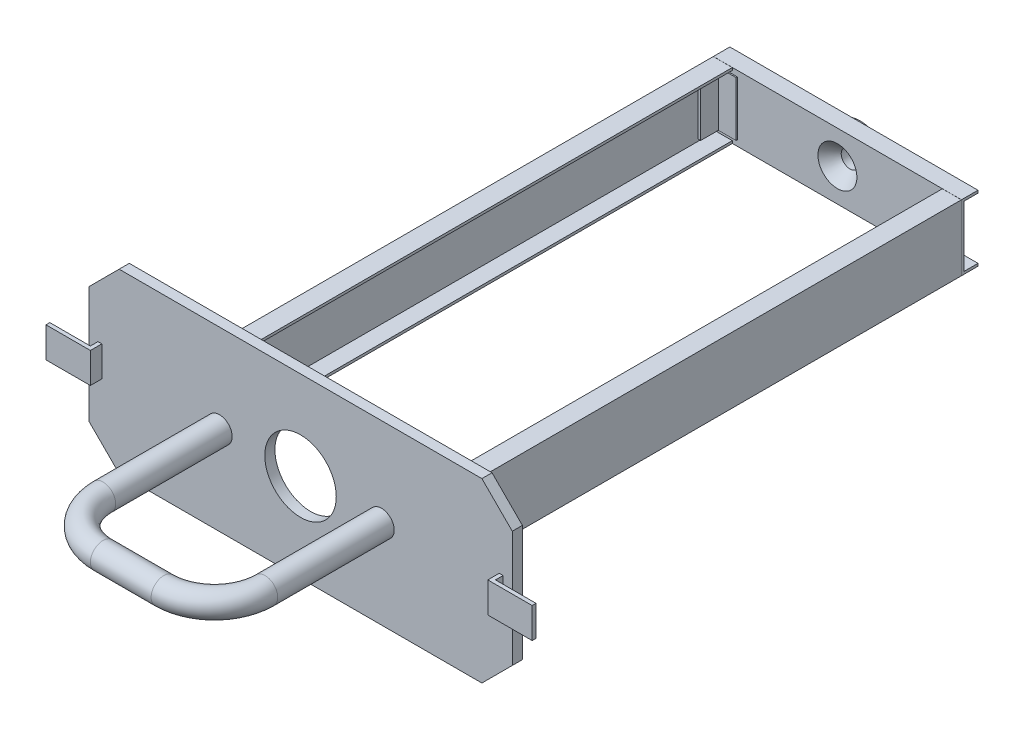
ISO-10303-21;
HEADER;
FILE_DESCRIPTION(('STEP AP214'),'2;1');
FILE_NAME('part.step','',(''),(''),'','','');
FILE_SCHEMA(('AUTOMOTIVE_DESIGN { 1 0 10303 214 1 1 1 1 }'));
ENDSEC;
DATA;
#1=APPLICATION_CONTEXT('core data for automotive mechanical design processes');
#2=APPLICATION_PROTOCOL_DEFINITION('international standard','automotive_design',2000,#1);
#3=PRODUCT_CONTEXT('',#1,'mechanical');
#4=PRODUCT('Part','Part','',(#3));
#5=PRODUCT_RELATED_PRODUCT_CATEGORY('part','',(#4));
#6=PRODUCT_DEFINITION_FORMATION('','',#4);
#7=PRODUCT_DEFINITION_CONTEXT('part definition',#1,'design');
#8=PRODUCT_DEFINITION('design','',#6,#7);
#9=PRODUCT_DEFINITION_SHAPE('','',#8);
#10=(LENGTH_UNIT() NAMED_UNIT(*) SI_UNIT(.MILLI.,.METRE.));
#11=(NAMED_UNIT(*) PLANE_ANGLE_UNIT() SI_UNIT($,.RADIAN.));
#12=(NAMED_UNIT(*) SI_UNIT($,.STERADIAN.) SOLID_ANGLE_UNIT());
#13=UNCERTAINTY_MEASURE_WITH_UNIT(LENGTH_MEASURE(1.E-05),#10,'distance_accuracy_value','');
#14=(GEOMETRIC_REPRESENTATION_CONTEXT(3) GLOBAL_UNCERTAINTY_ASSIGNED_CONTEXT((#13)) GLOBAL_UNIT_ASSIGNED_CONTEXT((#10,
#11,#12)) REPRESENTATION_CONTEXT('',''));
#15=CARTESIAN_POINT('',(0.,0.,0.));
#16=DIRECTION('',(0.,0.,1.));
#17=DIRECTION('',(1.,0.,0.));
#18=AXIS2_PLACEMENT_3D('',#15,#16,#17);
#19=CARTESIAN_POINT('',(-481.362031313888,82.55,-1321.054));
#20=DIRECTION('',(0.,0.,1.));
#21=DIRECTION('',(1.,0.,0.));
#22=AXIS2_PLACEMENT_3D('',#19,#20,#21);
#23=PLANE('',#22);
#24=DIRECTION('',(0.,1.,0.));
#25=VECTOR('',#24,1.);
#26=CARTESIAN_POINT('',(250.952,82.55,-1321.054));
#27=LINE('',#26,#25);
#28=CARTESIAN_POINT('',(250.952,-68.326,-1321.054));
#29=VERTEX_POINT('',#28);
#30=CARTESIAN_POINT('',(250.952,68.326,-1321.054));
#31=VERTEX_POINT('',#30);
#32=EDGE_CURVE('E56',#29,#31,#27,.T.);
#33=ORIENTED_EDGE('',*,*,#32,.T.);
#34=DIRECTION('',(1.,0.,0.));
#35=VECTOR('',#34,1.);
#36=CARTESIAN_POINT('',(-481.362031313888,68.326,-1321.054));
#37=LINE('',#36,#35);
#38=CARTESIAN_POINT('',(301.752,68.326,-1321.054));
#39=VERTEX_POINT('',#38);
#40=EDGE_CURVE('E45',#31,#39,#37,.T.);
#41=ORIENTED_EDGE('',*,*,#40,.T.);
#42=DIRECTION('',(0.,-1.,0.));
#43=VECTOR('',#42,1.);
#44=CARTESIAN_POINT('',(301.752,82.55,-1321.054));
#45=LINE('',#44,#43);
#46=CARTESIAN_POINT('',(301.752,-68.326,-1321.054));
#47=VERTEX_POINT('',#46);
#48=EDGE_CURVE('E333',#39,#47,#45,.T.);
#49=ORIENTED_EDGE('',*,*,#48,.T.);
#50=DIRECTION('',(1.,0.,0.));
#51=VECTOR('',#50,1.);
#52=CARTESIAN_POINT('',(-481.362031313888,-68.326,-1321.054));
#53=LINE('',#52,#51);
#54=EDGE_CURVE('E329',#29,#47,#53,.T.);
#55=ORIENTED_EDGE('',*,*,#54,.F.);
#56=EDGE_LOOP('',(#33,#41,#49,#55));
#57=FACE_BOUND('',#56,.T.);
#58=DIRECTION('',(0.,1.,0.));
#59=VECTOR('',#58,1.);
#60=CARTESIAN_POINT('',(-311.15,82.55,-1321.054));
#61=LINE('',#60,#59);
#62=CARTESIAN_POINT('',(-311.15,-82.55,-1321.054));
#63=VERTEX_POINT('',#62);
#64=CARTESIAN_POINT('',(-311.15,82.55,-1321.054));
#65=VERTEX_POINT('',#64);
#66=EDGE_CURVE('E273',#63,#65,#61,.T.);
#67=ORIENTED_EDGE('',*,*,#66,.F.);
#68=DIRECTION('',(1.,0.,0.));
#69=VECTOR('',#68,1.);
#70=CARTESIAN_POINT('',(-481.362031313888,-82.55,-1321.054));
#71=LINE('',#70,#69);
#72=CARTESIAN_POINT('',(311.15,-82.55,-1321.054));
#73=VERTEX_POINT('',#72);
#74=EDGE_CURVE('E302',#63,#73,#71,.T.);
#75=ORIENTED_EDGE('',*,*,#74,.T.);
#76=DIRECTION('',(0.,-1.,0.));
#77=VECTOR('',#76,1.);
#78=CARTESIAN_POINT('',(311.15,82.55,-1321.054));
#79=LINE('',#78,#77);
#80=CARTESIAN_POINT('',(311.15,82.55,-1321.054));
#81=VERTEX_POINT('',#80);
#82=EDGE_CURVE('E298',#81,#73,#79,.T.);
#83=ORIENTED_EDGE('',*,*,#82,.F.);
#84=DIRECTION('',(1.,0.,0.));
#85=VECTOR('',#84,1.);
#86=CARTESIAN_POINT('',(-481.362031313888,82.55,-1321.054));
#87=LINE('',#86,#85);
#88=EDGE_CURVE('E304',#65,#81,#87,.T.);
#89=ORIENTED_EDGE('',*,*,#88,.F.);
#90=EDGE_LOOP('',(#67,#75,#83,#89));
#91=FACE_BOUND('',#90,.T.);
#92=DIRECTION('',(0.,-1.,0.));
#93=VECTOR('',#92,1.);
#94=CARTESIAN_POINT('',(-301.752,82.55,-1321.054));
#95=LINE('',#94,#93);
#96=CARTESIAN_POINT('',(-301.752,68.326,-1321.054));
#97=VERTEX_POINT('',#96);
#98=CARTESIAN_POINT('',(-301.752,-68.326,-1321.054));
#99=VERTEX_POINT('',#98);
#100=EDGE_CURVE('E321',#97,#99,#95,.T.);
#101=ORIENTED_EDGE('',*,*,#100,.F.);
#102=DIRECTION('',(1.,0.,0.));
#103=VECTOR('',#102,1.);
#104=CARTESIAN_POINT('',(-481.362031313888,68.326,-1321.054));
#105=LINE('',#104,#103);
#106=CARTESIAN_POINT('',(-250.952,68.326,-1321.054));
#107=VERTEX_POINT('',#106);
#108=EDGE_CURVE('E327',#97,#107,#105,.T.);
#109=ORIENTED_EDGE('',*,*,#108,.T.);
#110=DIRECTION('',(0.,1.,0.));
#111=VECTOR('',#110,1.);
#112=CARTESIAN_POINT('',(-250.952,82.55,-1321.054));
#113=LINE('',#112,#111);
#114=CARTESIAN_POINT('',(-250.952,-68.326,-1321.054));
#115=VERTEX_POINT('',#114);
#116=EDGE_CURVE('E324',#115,#107,#113,.T.);
#117=ORIENTED_EDGE('',*,*,#116,.F.);
#118=DIRECTION('',(1.,0.,0.));
#119=VECTOR('',#118,1.);
#120=CARTESIAN_POINT('',(-481.362031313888,-68.326,-1321.054));
#121=LINE('',#120,#119);
#122=EDGE_CURVE('E277',#99,#115,#121,.T.);
#123=ORIENTED_EDGE('',*,*,#122,.F.);
#124=EDGE_LOOP('',(#101,#109,#117,#123));
#125=FACE_BOUND('',#124,.T.);
#126=CARTESIAN_POINT('',(0.,0.,-1321.054));
#127=DIRECTION('',(0.,0.,-1.));
#128=DIRECTION('',(-1.,0.,0.));
#129=AXIS2_PLACEMENT_3D('',#126,#127,#128);
#130=CIRCLE('',#129,48.8664132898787);
#131=CARTESIAN_POINT('',(-48.8664132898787,0.,-1321.054));
#132=VERTEX_POINT('',#131);
#133=EDGE_CURVE('E445',#132,#132,#130,.T.);
#134=ORIENTED_EDGE('',*,*,#133,.T.);
#135=EDGE_LOOP('',(#134));
#136=FACE_BOUND('',#135,.T.);
#137=ADVANCED_FACE('F37',(#57,#91,#125,#136),#23,.T.);
#138=CARTESIAN_POINT('',(0.,0.,-1378.204));
#139=DIRECTION('',(0.,0.,-1.));
#140=DIRECTION('',(-1.,0.,0.));
#141=AXIS2_PLACEMENT_3D('',#138,#139,#140);
#142=PLANE('',#141);
#143=CARTESIAN_POINT('',(0.,0.,-1378.204));
#144=DIRECTION('',(0.,0.,-1.));
#145=DIRECTION('',(-1.,0.,0.));
#146=AXIS2_PLACEMENT_3D('',#143,#144,#145);
#147=CIRCLE('',#146,69.85);
#148=CARTESIAN_POINT('',(-69.85,0.,-1378.204));
#149=VERTEX_POINT('',#148);
#150=EDGE_CURVE('E192',#149,#149,#147,.T.);
#151=ORIENTED_EDGE('',*,*,#150,.T.);
#152=EDGE_LOOP('',(#151));
#153=FACE_BOUND('',#152,.T.);
#154=CARTESIAN_POINT('',(0.,0.,-1378.204));
#155=DIRECTION('',(0.,0.,-1.));
#156=DIRECTION('',(-1.,0.,0.));
#157=AXIS2_PLACEMENT_3D('',#154,#155,#156);
#158=CIRCLE('',#157,22.225);
#159=CARTESIAN_POINT('',(-22.225,0.,-1378.204));
#160=VERTEX_POINT('',#159);
#161=EDGE_CURVE('E441',#160,#160,#158,.T.);
#162=ORIENTED_EDGE('',*,*,#161,.F.);
#163=EDGE_LOOP('',(#162));
#164=FACE_BOUND('',#163,.T.);
#165=ADVANCED_FACE('F356',(#153,#164),#142,.T.);
#166=CARTESIAN_POINT('',(-481.362031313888,82.55,-1327.404));
#167=DIRECTION('',(0.,0.,1.));
#168=DIRECTION('',(1.,0.,0.));
#169=AXIS2_PLACEMENT_3D('',#166,#167,#168);
#170=PLANE('',#169);
#171=DIRECTION('',(1.,0.,0.));
#172=VECTOR('',#171,1.);
#173=CARTESIAN_POINT('',(-481.362031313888,-76.2,-1327.404));
#174=LINE('',#173,#172);
#175=CARTESIAN_POINT('',(-311.15,-76.2,-1327.404));
#176=VERTEX_POINT('',#175);
#177=CARTESIAN_POINT('',(311.15,-76.2,-1327.404));
#178=VERTEX_POINT('',#177);
#179=EDGE_CURVE('E312',#176,#178,#174,.T.);
#180=ORIENTED_EDGE('',*,*,#179,.F.);
#181=DIRECTION('',(0.,1.,0.));
#182=VECTOR('',#181,1.);
#183=CARTESIAN_POINT('',(-311.15,82.55,-1327.404));
#184=LINE('',#183,#182);
#185=CARTESIAN_POINT('',(-311.15,76.2,-1327.404));
#186=VERTEX_POINT('',#185);
#187=EDGE_CURVE('E261',#176,#186,#184,.T.);
#188=ORIENTED_EDGE('',*,*,#187,.T.);
#189=DIRECTION('',(1.,0.,0.));
#190=VECTOR('',#189,1.);
#191=CARTESIAN_POINT('',(-481.362031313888,76.2,-1327.404));
#192=LINE('',#191,#190);
#193=CARTESIAN_POINT('',(311.15,76.2,-1327.404));
#194=VERTEX_POINT('',#193);
#195=EDGE_CURVE('E310',#186,#194,#192,.T.);
#196=ORIENTED_EDGE('',*,*,#195,.T.);
#197=DIRECTION('',(0.,1.,0.));
#198=VECTOR('',#197,1.);
#199=CARTESIAN_POINT('',(311.15,82.55,-1327.404));
#200=LINE('',#199,#198);
#201=EDGE_CURVE('E286',#194,#178,#200,.F.);
#202=ORIENTED_EDGE('',*,*,#201,.T.);
#203=EDGE_LOOP('',(#180,#188,#196,#202));
#204=FACE_BOUND('',#203,.T.);
#205=CARTESIAN_POINT('',(0.,0.,-1327.404));
#206=DIRECTION('',(0.,0.,1.));
#207=DIRECTION('',(1.,0.,0.));
#208=AXIS2_PLACEMENT_3D('',#205,#206,#207);
#209=CIRCLE('',#208,69.85);
#210=CARTESIAN_POINT('',(69.85,0.,-1327.404));
#211=VERTEX_POINT('',#210);
#212=EDGE_CURVE('E12',#211,#211,#209,.F.);
#213=ORIENTED_EDGE('',*,*,#212,.F.);
#214=EDGE_LOOP('',(#213));
#215=FACE_BOUND('',#214,.T.);
#216=ADVANCED_FACE('F362',(#204,#215),#170,.F.);
#217=CARTESIAN_POINT('',(311.15,-82.55,-1362.456));
#218=DIRECTION('',(-1.,0.,0.));
#219=DIRECTION('',(0.,0.,1.));
#220=AXIS2_PLACEMENT_3D('',#217,#218,#219);
#221=PLANE('',#220);
#222=DIRECTION('',(0.,0.,-1.));
#223=VECTOR('',#222,1.);
#224=CARTESIAN_POINT('',(311.15,-82.55,-1321.054));
#225=LINE('',#224,#223);
#226=CARTESIAN_POINT('',(311.15,-82.55,-1362.456));
#227=VERTEX_POINT('',#226);
#228=EDGE_CURVE('E257',#73,#227,#225,.T.);
#229=ORIENTED_EDGE('',*,*,#228,.T.);
#230=DIRECTION('',(0.,-1.,0.));
#231=VECTOR('',#230,1.);
#232=CARTESIAN_POINT('',(311.15,-76.2,-1362.456));
#233=LINE('',#232,#231);
#234=CARTESIAN_POINT('',(311.15,-76.2,-1362.456));
#235=VERTEX_POINT('',#234);
#236=EDGE_CURVE('E280',#235,#227,#233,.T.);
#237=ORIENTED_EDGE('',*,*,#236,.F.);
#238=DIRECTION('',(0.,0.,-1.));
#239=VECTOR('',#238,1.);
#240=CARTESIAN_POINT('',(311.15,-76.2,-1321.054));
#241=LINE('',#240,#239);
#242=EDGE_CURVE('E283',#178,#235,#241,.T.);
#243=ORIENTED_EDGE('',*,*,#242,.F.);
#244=ORIENTED_EDGE('',*,*,#201,.F.);
#245=DIRECTION('',(0.,0.,1.));
#246=VECTOR('',#245,1.);
#247=CARTESIAN_POINT('',(311.15,76.2,-1362.456));
#248=LINE('',#247,#246);
#249=CARTESIAN_POINT('',(311.15,76.2,-1362.456));
#250=VERTEX_POINT('',#249);
#251=EDGE_CURVE('E289',#250,#194,#248,.T.);
#252=ORIENTED_EDGE('',*,*,#251,.F.);
#253=DIRECTION('',(0.,-1.,0.));
#254=VECTOR('',#253,1.);
#255=CARTESIAN_POINT('',(311.15,82.55,-1362.456));
#256=LINE('',#255,#254);
#257=CARTESIAN_POINT('',(311.15,82.55,-1362.456));
#258=VERTEX_POINT('',#257);
#259=EDGE_CURVE('E292',#258,#250,#256,.T.);
#260=ORIENTED_EDGE('',*,*,#259,.F.);
#261=DIRECTION('',(0.,0.,1.));
#262=VECTOR('',#261,1.);
#263=CARTESIAN_POINT('',(311.15,82.55,-1362.456));
#264=LINE('',#263,#262);
#265=EDGE_CURVE('E295',#258,#81,#264,.T.);
#266=ORIENTED_EDGE('',*,*,#265,.T.);
#267=ORIENTED_EDGE('',*,*,#82,.T.);
#268=EDGE_LOOP('',(#229,#237,#243,#244,#252,#260,#266,#267));
#269=FACE_BOUND('',#268,.T.);
#270=ADVANCED_FACE('F367',(#269),#221,.F.);
#271=CARTESIAN_POINT('',(-481.362031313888,-76.2,-1362.456));
#272=DIRECTION('',(0.,0.,1.));
#273=DIRECTION('',(1.,0.,0.));
#274=AXIS2_PLACEMENT_3D('',#271,#272,#273);
#275=PLANE('',#274);
#276=DIRECTION('',(1.,0.,0.));
#277=VECTOR('',#276,1.);
#278=CARTESIAN_POINT('',(-481.362031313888,-82.55,-1362.456));
#279=LINE('',#278,#277);
#280=CARTESIAN_POINT('',(-311.15,-82.55,-1362.456));
#281=VERTEX_POINT('',#280);
#282=EDGE_CURVE('E301',#281,#227,#279,.T.);
#283=ORIENTED_EDGE('',*,*,#282,.F.);
#284=DIRECTION('',(0.,1.,0.));
#285=VECTOR('',#284,1.);
#286=CARTESIAN_POINT('',(-311.15,-76.2,-1362.456));
#287=LINE('',#286,#285);
#288=CARTESIAN_POINT('',(-311.15,-76.2,-1362.456));
#289=VERTEX_POINT('',#288);
#290=EDGE_CURVE('E262',#281,#289,#287,.T.);
#291=ORIENTED_EDGE('',*,*,#290,.T.);
#292=DIRECTION('',(1.,0.,0.));
#293=VECTOR('',#292,1.);
#294=CARTESIAN_POINT('',(-481.362031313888,-76.2,-1362.456));
#295=LINE('',#294,#293);
#296=EDGE_CURVE('E314',#289,#235,#295,.T.);
#297=ORIENTED_EDGE('',*,*,#296,.T.);
#298=ORIENTED_EDGE('',*,*,#236,.T.);
#299=EDGE_LOOP('',(#283,#291,#297,#298));
#300=FACE_BOUND('',#299,.T.);
#301=ADVANCED_FACE('F386',(#300),#275,.F.);
#302=CARTESIAN_POINT('',(-481.362031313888,-76.2,-1321.054));
#303=DIRECTION('',(0.,-1.,0.));
#304=DIRECTION('',(0.,0.,-1.));
#305=AXIS2_PLACEMENT_3D('',#302,#303,#304);
#306=PLANE('',#305);
#307=ORIENTED_EDGE('',*,*,#296,.F.);
#308=DIRECTION('',(0.,0.,1.));
#309=VECTOR('',#308,1.);
#310=CARTESIAN_POINT('',(-311.15,-76.2,-1321.054));
#311=LINE('',#310,#309);
#312=EDGE_CURVE('E258',#289,#176,#311,.T.);
#313=ORIENTED_EDGE('',*,*,#312,.T.);
#314=ORIENTED_EDGE('',*,*,#179,.T.);
#315=ORIENTED_EDGE('',*,*,#242,.T.);
#316=EDGE_LOOP('',(#307,#313,#314,#315));
#317=FACE_BOUND('',#316,.T.);
#318=ADVANCED_FACE('F380',(#317),#306,.F.);
#319=CARTESIAN_POINT('',(-481.362031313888,76.2,-1362.456));
#320=DIRECTION('',(0.,1.,0.));
#321=DIRECTION('',(0.,0.,1.));
#322=AXIS2_PLACEMENT_3D('',#319,#320,#321);
#323=PLANE('',#322);
#324=ORIENTED_EDGE('',*,*,#195,.F.);
#325=DIRECTION('',(0.,0.,-1.));
#326=VECTOR('',#325,1.);
#327=CARTESIAN_POINT('',(-311.15,76.2,-1362.456));
#328=LINE('',#327,#326);
#329=CARTESIAN_POINT('',(-311.15,76.2,-1362.456));
#330=VERTEX_POINT('',#329);
#331=EDGE_CURVE('E265',#186,#330,#328,.T.);
#332=ORIENTED_EDGE('',*,*,#331,.T.);
#333=DIRECTION('',(1.,0.,0.));
#334=VECTOR('',#333,1.);
#335=CARTESIAN_POINT('',(-481.362031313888,76.2,-1362.456));
#336=LINE('',#335,#334);
#337=EDGE_CURVE('E308',#330,#250,#336,.T.);
#338=ORIENTED_EDGE('',*,*,#337,.T.);
#339=ORIENTED_EDGE('',*,*,#251,.T.);
#340=EDGE_LOOP('',(#324,#332,#338,#339));
#341=FACE_BOUND('',#340,.T.);
#342=ADVANCED_FACE('F376',(#341),#323,.F.);
#343=CARTESIAN_POINT('',(-481.362031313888,82.55,-1362.456));
#344=DIRECTION('',(0.,0.,1.));
#345=DIRECTION('',(1.,0.,0.));
#346=AXIS2_PLACEMENT_3D('',#343,#344,#345);
#347=PLANE('',#346);
#348=ORIENTED_EDGE('',*,*,#337,.F.);
#349=DIRECTION('',(0.,1.,0.));
#350=VECTOR('',#349,1.);
#351=CARTESIAN_POINT('',(-311.15,82.55,-1362.456));
#352=LINE('',#351,#350);
#353=CARTESIAN_POINT('',(-311.15,82.55,-1362.456));
#354=VERTEX_POINT('',#353);
#355=EDGE_CURVE('E268',#330,#354,#352,.T.);
#356=ORIENTED_EDGE('',*,*,#355,.T.);
#357=DIRECTION('',(1.,0.,0.));
#358=VECTOR('',#357,1.);
#359=CARTESIAN_POINT('',(-481.362031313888,82.55,-1362.456));
#360=LINE('',#359,#358);
#361=EDGE_CURVE('E306',#354,#258,#360,.T.);
#362=ORIENTED_EDGE('',*,*,#361,.T.);
#363=ORIENTED_EDGE('',*,*,#259,.T.);
#364=EDGE_LOOP('',(#348,#356,#362,#363));
#365=FACE_BOUND('',#364,.T.);
#366=ADVANCED_FACE('F372',(#365),#347,.F.);
#367=CARTESIAN_POINT('',(-481.362031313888,82.55,-1362.456));
#368=DIRECTION('',(0.,1.,0.));
#369=DIRECTION('',(0.,0.,1.));
#370=AXIS2_PLACEMENT_3D('',#367,#368,#369);
#371=PLANE('',#370);
#372=DIRECTION('',(0.,0.,-1.));
#373=VECTOR('',#372,1.);
#374=CARTESIAN_POINT('',(-311.15,82.55,-1362.456));
#375=LINE('',#374,#373);
#376=EDGE_CURVE('E271',#65,#354,#375,.T.);
#377=ORIENTED_EDGE('',*,*,#376,.F.);
#378=ORIENTED_EDGE('',*,*,#88,.T.);
#379=ORIENTED_EDGE('',*,*,#265,.F.);
#380=ORIENTED_EDGE('',*,*,#361,.F.);
#381=EDGE_LOOP('',(#377,#378,#379,#380));
#382=FACE_BOUND('',#381,.T.);
#383=ADVANCED_FACE('F369',(#382),#371,.T.);
#384=CARTESIAN_POINT('',(-481.362031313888,-82.55,-1321.054));
#385=DIRECTION('',(0.,-1.,0.));
#386=DIRECTION('',(0.,0.,-1.));
#387=AXIS2_PLACEMENT_3D('',#384,#385,#386);
#388=PLANE('',#387);
#389=DIRECTION('',(0.,0.,1.));
#390=VECTOR('',#389,1.);
#391=CARTESIAN_POINT('',(-311.15,-82.55,-1321.054));
#392=LINE('',#391,#390);
#393=EDGE_CURVE('E275',#281,#63,#392,.T.);
#394=ORIENTED_EDGE('',*,*,#393,.F.);
#395=ORIENTED_EDGE('',*,*,#282,.T.);
#396=ORIENTED_EDGE('',*,*,#228,.F.);
#397=ORIENTED_EDGE('',*,*,#74,.F.);
#398=EDGE_LOOP('',(#394,#395,#396,#397));
#399=FACE_BOUND('',#398,.T.);
#400=ADVANCED_FACE('F39',(#399),#388,.T.);
#401=CARTESIAN_POINT('',(-311.15,76.2,-1320.8));
#402=DIRECTION('',(1.,0.,0.));
#403=DIRECTION('',(0.,0.,1.));
#404=AXIS2_PLACEMENT_3D('',#401,#402,#403);
#405=PLANE('',#404);
#406=ORIENTED_EDGE('',*,*,#393,.T.);
#407=ORIENTED_EDGE('',*,*,#66,.T.);
#408=ORIENTED_EDGE('',*,*,#376,.T.);
#409=ORIENTED_EDGE('',*,*,#355,.F.);
#410=ORIENTED_EDGE('',*,*,#331,.F.);
#411=ORIENTED_EDGE('',*,*,#187,.F.);
#412=ORIENTED_EDGE('',*,*,#312,.F.);
#413=ORIENTED_EDGE('',*,*,#290,.F.);
#414=EDGE_LOOP('',(#406,#407,#408,#409,#410,#411,#412,#413));
#415=FACE_BOUND('',#414,.T.);
#416=ADVANCED_FACE('F402',(#415),#405,.F.);
#417=CARTESIAN_POINT('',(-301.752,68.326,-1318.006));
#418=DIRECTION('',(0.,0.,-1.));
#419=DIRECTION('',(-1.,0.,0.));
#420=AXIS2_PLACEMENT_3D('',#417,#418,#419);
#421=PLANE('',#420);
#422=DIRECTION('',(1.,0.,0.));
#423=VECTOR('',#422,1.);
#424=CARTESIAN_POINT('',(-301.752,-68.326,-1318.006));
#425=LINE('',#424,#423);
#426=CARTESIAN_POINT('',(-295.402,-68.326,-1318.006));
#427=VERTEX_POINT('',#426);
#428=CARTESIAN_POINT('',(-250.952,-68.326,-1318.006));
#429=VERTEX_POINT('',#428);
#430=EDGE_CURVE('E181',#427,#429,#425,.T.);
#431=ORIENTED_EDGE('',*,*,#430,.T.);
#432=DIRECTION('',(0.,-1.,0.));
#433=VECTOR('',#432,1.);
#434=CARTESIAN_POINT('',(-250.952,68.326,-1318.006));
#435=LINE('',#434,#433);
#436=CARTESIAN_POINT('',(-250.952,68.326,-1318.006));
#437=VERTEX_POINT('',#436);
#438=EDGE_CURVE('E254',#437,#429,#435,.T.);
#439=ORIENTED_EDGE('',*,*,#438,.F.);
#440=DIRECTION('',(1.,0.,0.));
#441=VECTOR('',#440,1.);
#442=CARTESIAN_POINT('',(-301.752,68.326,-1318.006));
#443=LINE('',#442,#441);
#444=CARTESIAN_POINT('',(-295.402,68.326,-1318.006));
#445=VERTEX_POINT('',#444);
#446=EDGE_CURVE('E234',#445,#437,#443,.T.);
#447=ORIENTED_EDGE('',*,*,#446,.F.);
#448=DIRECTION('',(0.,-1.,0.));
#449=VECTOR('',#448,1.);
#450=CARTESIAN_POINT('',(-295.402,68.326,-1318.006));
#451=LINE('',#450,#449);
#452=EDGE_CURVE('E247',#445,#427,#451,.T.);
#453=ORIENTED_EDGE('',*,*,#452,.T.);
#454=EDGE_LOOP('',(#431,#439,#447,#453));
#455=FACE_BOUND('',#454,.T.);
#456=ADVANCED_FACE('F551',(#455),#421,.F.);
#457=CARTESIAN_POINT('',(-250.952,68.326,-1324.356));
#458=DIRECTION('',(1.,0.,0.));
#459=DIRECTION('',(0.,0.,-1.));
#460=AXIS2_PLACEMENT_3D('',#457,#458,#459);
#461=PLANE('',#460);
#462=DIRECTION('',(0.,0.,1.));
#463=VECTOR('',#462,1.);
#464=CARTESIAN_POINT('',(-250.952,-68.326,-1324.356));
#465=LINE('',#464,#463);
#466=EDGE_CURVE('E224',#115,#429,#465,.T.);
#467=ORIENTED_EDGE('',*,*,#466,.F.);
#468=ORIENTED_EDGE('',*,*,#116,.T.);
#469=DIRECTION('',(0.,0.,1.));
#470=VECTOR('',#469,1.);
#471=CARTESIAN_POINT('',(-250.952,68.326,-1324.356));
#472=LINE('',#471,#470);
#473=EDGE_CURVE('E237',#107,#437,#472,.T.);
#474=ORIENTED_EDGE('',*,*,#473,.T.);
#475=ORIENTED_EDGE('',*,*,#438,.T.);
#476=EDGE_LOOP('',(#467,#468,#474,#475));
#477=FACE_BOUND('',#476,.T.);
#478=ADVANCED_FACE('F543',(#477),#461,.T.);
#479=CARTESIAN_POINT('',(-301.752,68.326,-1273.556));
#480=DIRECTION('',(-1.,0.,0.));
#481=DIRECTION('',(0.,0.,1.));
#482=AXIS2_PLACEMENT_3D('',#479,#480,#481);
#483=PLANE('',#482);
#484=DIRECTION('',(0.,0.,-1.));
#485=VECTOR('',#484,1.);
#486=CARTESIAN_POINT('',(-301.752,68.326,-1273.556));
#487=LINE('',#486,#485);
#488=CARTESIAN_POINT('',(-301.752,68.326,-1273.556));
#489=VERTEX_POINT('',#488);
#490=EDGE_CURVE('E239',#489,#97,#487,.T.);
#491=ORIENTED_EDGE('',*,*,#490,.T.);
#492=ORIENTED_EDGE('',*,*,#100,.T.);
#493=DIRECTION('',(0.,0.,-1.));
#494=VECTOR('',#493,1.);
#495=CARTESIAN_POINT('',(-301.752,-68.326,-1273.556));
#496=LINE('',#495,#494);
#497=CARTESIAN_POINT('',(-301.752,-68.326,-1273.556));
#498=VERTEX_POINT('',#497);
#499=EDGE_CURVE('E226',#498,#99,#496,.T.);
#500=ORIENTED_EDGE('',*,*,#499,.F.);
#501=DIRECTION('',(0.,-1.,0.));
#502=VECTOR('',#501,1.);
#503=CARTESIAN_POINT('',(-301.752,68.326,-1273.556));
#504=LINE('',#503,#502);
#505=EDGE_CURVE('E252',#489,#498,#504,.T.);
#506=ORIENTED_EDGE('',*,*,#505,.F.);
#507=EDGE_LOOP('',(#491,#492,#500,#506));
#508=FACE_BOUND('',#507,.T.);
#509=ADVANCED_FACE('F535',(#508),#483,.T.);
#510=CARTESIAN_POINT('',(-295.402,68.326,-1273.556));
#511=DIRECTION('',(0.,0.,1.));
#512=DIRECTION('',(1.,0.,0.));
#513=AXIS2_PLACEMENT_3D('',#510,#511,#512);
#514=PLANE('',#513);
#515=DIRECTION('',(-1.,0.,0.));
#516=VECTOR('',#515,1.);
#517=CARTESIAN_POINT('',(-295.402,-68.326,-1273.556));
#518=LINE('',#517,#516);
#519=CARTESIAN_POINT('',(-295.402,-68.326,-1273.556));
#520=VERTEX_POINT('',#519);
#521=EDGE_CURVE('E229',#520,#498,#518,.T.);
#522=ORIENTED_EDGE('',*,*,#521,.F.);
#523=DIRECTION('',(0.,-1.,0.));
#524=VECTOR('',#523,1.);
#525=CARTESIAN_POINT('',(-295.402,68.326,-1273.556));
#526=LINE('',#525,#524);
#527=CARTESIAN_POINT('',(-295.402,68.326,-1273.556));
#528=VERTEX_POINT('',#527);
#529=EDGE_CURVE('E250',#528,#520,#526,.T.);
#530=ORIENTED_EDGE('',*,*,#529,.F.);
#531=DIRECTION('',(-1.,0.,0.));
#532=VECTOR('',#531,1.);
#533=CARTESIAN_POINT('',(-295.402,68.326,-1273.556));
#534=LINE('',#533,#532);
#535=EDGE_CURVE('E242',#528,#489,#534,.T.);
#536=ORIENTED_EDGE('',*,*,#535,.T.);
#537=ORIENTED_EDGE('',*,*,#505,.T.);
#538=EDGE_LOOP('',(#522,#530,#536,#537));
#539=FACE_BOUND('',#538,.T.);
#540=ADVANCED_FACE('F527',(#539),#514,.T.);
#541=CARTESIAN_POINT('',(-295.402,68.326,-1273.556));
#542=DIRECTION('',(-1.,0.,0.));
#543=DIRECTION('',(0.,0.,1.));
#544=AXIS2_PLACEMENT_3D('',#541,#542,#543);
#545=PLANE('',#544);
#546=DIRECTION('',(0.,0.,-1.));
#547=VECTOR('',#546,1.);
#548=CARTESIAN_POINT('',(-295.402,-68.326,-1273.556));
#549=LINE('',#548,#547);
#550=EDGE_CURVE('E232',#520,#427,#549,.T.);
#551=ORIENTED_EDGE('',*,*,#550,.T.);
#552=ORIENTED_EDGE('',*,*,#452,.F.);
#553=DIRECTION('',(0.,0.,-1.));
#554=VECTOR('',#553,1.);
#555=CARTESIAN_POINT('',(-295.402,68.326,-1273.556));
#556=LINE('',#555,#554);
#557=EDGE_CURVE('E245',#528,#445,#556,.T.);
#558=ORIENTED_EDGE('',*,*,#557,.F.);
#559=ORIENTED_EDGE('',*,*,#529,.T.);
#560=EDGE_LOOP('',(#551,#552,#558,#559));
#561=FACE_BOUND('',#560,.T.);
#562=ADVANCED_FACE('F519',(#561),#545,.F.);
#563=CARTESIAN_POINT('',(-250.952,68.326,-1318.006));
#564=DIRECTION('',(0.,-1.,0.));
#565=DIRECTION('',(0.,0.,-1.));
#566=AXIS2_PLACEMENT_3D('',#563,#564,#565);
#567=PLANE('',#566);
#568=ORIENTED_EDGE('',*,*,#108,.F.);
#569=ORIENTED_EDGE('',*,*,#490,.F.);
#570=ORIENTED_EDGE('',*,*,#535,.F.);
#571=ORIENTED_EDGE('',*,*,#557,.T.);
#572=ORIENTED_EDGE('',*,*,#446,.T.);
#573=ORIENTED_EDGE('',*,*,#473,.F.);
#574=EDGE_LOOP('',(#568,#569,#570,#571,#572,#573));
#575=FACE_BOUND('',#574,.T.);
#576=ADVANCED_FACE('F511',(#575),#567,.F.);
#577=CARTESIAN_POINT('',(-250.952,-68.326,-1318.006));
#578=DIRECTION('',(0.,-1.,0.));
#579=DIRECTION('',(0.,0.,-1.));
#580=AXIS2_PLACEMENT_3D('',#577,#578,#579);
#581=PLANE('',#580);
#582=ORIENTED_EDGE('',*,*,#499,.T.);
#583=ORIENTED_EDGE('',*,*,#122,.T.);
#584=ORIENTED_EDGE('',*,*,#466,.T.);
#585=ORIENTED_EDGE('',*,*,#430,.F.);
#586=ORIENTED_EDGE('',*,*,#550,.F.);
#587=ORIENTED_EDGE('',*,*,#521,.T.);
#588=EDGE_LOOP('',(#582,#583,#584,#585,#586,#587));
#589=FACE_BOUND('',#588,.T.);
#590=ADVANCED_FACE('F504',(#589),#581,.T.);
#591=CARTESIAN_POINT('',(301.752,68.326,-1318.006));
#592=DIRECTION('',(0.,0.,1.));
#593=DIRECTION('',(1.,0.,0.));
#594=AXIS2_PLACEMENT_3D('',#591,#592,#593);
#595=PLANE('',#594);
#596=DIRECTION('',(-1.,0.,0.));
#597=VECTOR('',#596,1.);
#598=CARTESIAN_POINT('',(301.752,-68.326,-1318.006));
#599=LINE('',#598,#597);
#600=CARTESIAN_POINT('',(295.402,-68.326,-1318.006));
#601=VERTEX_POINT('',#600);
#602=CARTESIAN_POINT('',(250.952,-68.326,-1318.006));
#603=VERTEX_POINT('',#602);
#604=EDGE_CURVE('E186',#601,#603,#599,.T.);
#605=ORIENTED_EDGE('',*,*,#604,.F.);
#606=DIRECTION('',(0.,-1.,0.));
#607=VECTOR('',#606,1.);
#608=CARTESIAN_POINT('',(295.402,68.326,-1318.006));
#609=LINE('',#608,#607);
#610=CARTESIAN_POINT('',(295.402,68.326,-1318.006));
#611=VERTEX_POINT('',#610);
#612=EDGE_CURVE('E171',#611,#601,#609,.T.);
#613=ORIENTED_EDGE('',*,*,#612,.F.);
#614=DIRECTION('',(-1.,0.,0.));
#615=VECTOR('',#614,1.);
#616=CARTESIAN_POINT('',(301.752,68.326,-1318.006));
#617=LINE('',#616,#615);
#618=CARTESIAN_POINT('',(250.952,68.326,-1318.006));
#619=VERTEX_POINT('',#618);
#620=EDGE_CURVE('E207',#611,#619,#617,.T.);
#621=ORIENTED_EDGE('',*,*,#620,.T.);
#622=DIRECTION('',(0.,-1.,0.));
#623=VECTOR('',#622,1.);
#624=CARTESIAN_POINT('',(250.952,68.326,-1318.006));
#625=LINE('',#624,#623);
#626=EDGE_CURVE('E189',#619,#603,#625,.T.);
#627=ORIENTED_EDGE('',*,*,#626,.T.);
#628=EDGE_LOOP('',(#605,#613,#621,#627));
#629=FACE_BOUND('',#628,.T.);
#630=ADVANCED_FACE('F187',(#629),#595,.T.);
#631=CARTESIAN_POINT('',(295.402,68.326,-1273.556));
#632=DIRECTION('',(-1.,0.,0.));
#633=DIRECTION('',(0.,0.,1.));
#634=AXIS2_PLACEMENT_3D('',#631,#632,#633);
#635=PLANE('',#634);
#636=DIRECTION('',(0.,0.,-1.));
#637=VECTOR('',#636,1.);
#638=CARTESIAN_POINT('',(295.402,-68.326,-1273.556));
#639=LINE('',#638,#637);
#640=CARTESIAN_POINT('',(295.402,-68.326,-1273.556));
#641=VERTEX_POINT('',#640);
#642=EDGE_CURVE('E175',#641,#601,#639,.T.);
#643=ORIENTED_EDGE('',*,*,#642,.F.);
#644=DIRECTION('',(0.,-1.,0.));
#645=VECTOR('',#644,1.);
#646=CARTESIAN_POINT('',(295.402,68.326,-1273.556));
#647=LINE('',#646,#645);
#648=CARTESIAN_POINT('',(295.402,68.326,-1273.556));
#649=VERTEX_POINT('',#648);
#650=EDGE_CURVE('E182',#649,#641,#647,.T.);
#651=ORIENTED_EDGE('',*,*,#650,.F.);
#652=DIRECTION('',(0.,0.,-1.));
#653=VECTOR('',#652,1.);
#654=CARTESIAN_POINT('',(295.402,68.326,-1273.556));
#655=LINE('',#654,#653);
#656=EDGE_CURVE('E177',#649,#611,#655,.T.);
#657=ORIENTED_EDGE('',*,*,#656,.T.);
#658=ORIENTED_EDGE('',*,*,#612,.T.);
#659=EDGE_LOOP('',(#643,#651,#657,#658));
#660=FACE_BOUND('',#659,.T.);
#661=ADVANCED_FACE('F173',(#660),#635,.T.);
#662=CARTESIAN_POINT('',(295.402,68.326,-1273.556));
#663=DIRECTION('',(0.,0.,-1.));
#664=DIRECTION('',(-1.,0.,0.));
#665=AXIS2_PLACEMENT_3D('',#662,#663,#664);
#666=PLANE('',#665);
#667=DIRECTION('',(1.,0.,0.));
#668=VECTOR('',#667,1.);
#669=CARTESIAN_POINT('',(295.402,-68.326,-1273.556));
#670=LINE('',#669,#668);
#671=CARTESIAN_POINT('',(301.752,-68.326,-1273.556));
#672=VERTEX_POINT('',#671);
#673=EDGE_CURVE('E197',#641,#672,#670,.T.);
#674=ORIENTED_EDGE('',*,*,#673,.T.);
#675=DIRECTION('',(0.,-1.,0.));
#676=VECTOR('',#675,1.);
#677=CARTESIAN_POINT('',(301.752,68.326,-1273.556));
#678=LINE('',#677,#676);
#679=CARTESIAN_POINT('',(301.752,68.326,-1273.556));
#680=VERTEX_POINT('',#679);
#681=EDGE_CURVE('E218',#680,#672,#678,.T.);
#682=ORIENTED_EDGE('',*,*,#681,.F.);
#683=DIRECTION('',(1.,0.,0.));
#684=VECTOR('',#683,1.);
#685=CARTESIAN_POINT('',(295.402,68.326,-1273.556));
#686=LINE('',#685,#684);
#687=EDGE_CURVE('E210',#649,#680,#686,.T.);
#688=ORIENTED_EDGE('',*,*,#687,.F.);
#689=ORIENTED_EDGE('',*,*,#650,.T.);
#690=EDGE_LOOP('',(#674,#682,#688,#689));
#691=FACE_BOUND('',#690,.T.);
#692=ADVANCED_FACE('F341',(#691),#666,.F.);
#693=CARTESIAN_POINT('',(301.752,68.326,-1273.556));
#694=DIRECTION('',(-1.,0.,0.));
#695=DIRECTION('',(0.,0.,1.));
#696=AXIS2_PLACEMENT_3D('',#693,#694,#695);
#697=PLANE('',#696);
#698=ORIENTED_EDGE('',*,*,#48,.F.);
#699=DIRECTION('',(0.,0.,-1.));
#700=VECTOR('',#699,1.);
#701=CARTESIAN_POINT('',(301.752,68.326,-1273.556));
#702=LINE('',#701,#700);
#703=EDGE_CURVE('E212',#680,#39,#702,.T.);
#704=ORIENTED_EDGE('',*,*,#703,.F.);
#705=ORIENTED_EDGE('',*,*,#681,.T.);
#706=DIRECTION('',(0.,0.,-1.));
#707=VECTOR('',#706,1.);
#708=CARTESIAN_POINT('',(301.752,-68.326,-1273.556));
#709=LINE('',#708,#707);
#710=EDGE_CURVE('E199',#672,#47,#709,.T.);
#711=ORIENTED_EDGE('',*,*,#710,.T.);
#712=EDGE_LOOP('',(#698,#704,#705,#711));
#713=FACE_BOUND('',#712,.T.);
#714=ADVANCED_FACE('F337',(#713),#697,.F.);
#715=CARTESIAN_POINT('',(250.952,68.326,-1324.356));
#716=DIRECTION('',(1.,0.,0.));
#717=DIRECTION('',(0.,0.,-1.));
#718=AXIS2_PLACEMENT_3D('',#715,#716,#717);
#719=PLANE('',#718);
#720=ORIENTED_EDGE('',*,*,#32,.F.);
#721=DIRECTION('',(0.,0.,1.));
#722=VECTOR('',#721,1.);
#723=CARTESIAN_POINT('',(250.952,-68.326,-1324.356));
#724=LINE('',#723,#722);
#725=EDGE_CURVE('E205',#29,#603,#724,.T.);
#726=ORIENTED_EDGE('',*,*,#725,.T.);
#727=ORIENTED_EDGE('',*,*,#626,.F.);
#728=DIRECTION('',(0.,0.,1.));
#729=VECTOR('',#728,1.);
#730=CARTESIAN_POINT('',(250.952,68.326,-1324.356));
#731=LINE('',#730,#729);
#732=EDGE_CURVE('E215',#31,#619,#731,.T.);
#733=ORIENTED_EDGE('',*,*,#732,.F.);
#734=EDGE_LOOP('',(#720,#726,#727,#733));
#735=FACE_BOUND('',#734,.T.);
#736=ADVANCED_FACE('F346',(#735),#719,.F.);
#737=CARTESIAN_POINT('',(295.402,68.326,-1318.006));
#738=DIRECTION('',(0.,-1.,0.));
#739=DIRECTION('',(0.,0.,-1.));
#740=AXIS2_PLACEMENT_3D('',#737,#738,#739);
#741=PLANE('',#740);
#742=ORIENTED_EDGE('',*,*,#40,.F.);
#743=ORIENTED_EDGE('',*,*,#732,.T.);
#744=ORIENTED_EDGE('',*,*,#620,.F.);
#745=ORIENTED_EDGE('',*,*,#656,.F.);
#746=ORIENTED_EDGE('',*,*,#687,.T.);
#747=ORIENTED_EDGE('',*,*,#703,.T.);
#748=EDGE_LOOP('',(#742,#743,#744,#745,#746,#747));
#749=FACE_BOUND('',#748,.T.);
#750=ADVANCED_FACE('F343',(#749),#741,.F.);
#751=CARTESIAN_POINT('',(295.402,-68.326,-1318.006));
#752=DIRECTION('',(0.,-1.,0.));
#753=DIRECTION('',(0.,0.,-1.));
#754=AXIS2_PLACEMENT_3D('',#751,#752,#753);
#755=PLANE('',#754);
#756=ORIENTED_EDGE('',*,*,#725,.F.);
#757=ORIENTED_EDGE('',*,*,#54,.T.);
#758=ORIENTED_EDGE('',*,*,#710,.F.);
#759=ORIENTED_EDGE('',*,*,#673,.F.);
#760=ORIENTED_EDGE('',*,*,#642,.T.);
#761=ORIENTED_EDGE('',*,*,#604,.T.);
#762=EDGE_LOOP('',(#756,#757,#758,#759,#760,#761));
#763=FACE_BOUND('',#762,.T.);
#764=ADVANCED_FACE('F195',(#763),#755,.T.);
#765=CARTESIAN_POINT('',(0.,0.,-1378.204));
#766=DIRECTION('',(0.,0.,1.));
#767=DIRECTION('',(1.,0.,0.));
#768=AXIS2_PLACEMENT_3D('',#765,#766,#767);
#769=CYLINDRICAL_SURFACE('',#768,69.85);
#770=ORIENTED_EDGE('',*,*,#150,.F.);
#771=EDGE_LOOP('',(#770));
#772=FACE_BOUND('',#771,.T.);
#773=ORIENTED_EDGE('',*,*,#212,.T.);
#774=EDGE_LOOP('',(#773));
#775=FACE_BOUND('',#774,.T.);
#776=ADVANCED_FACE('F420',(#772,#775),#769,.T.);
#777=CARTESIAN_POINT('',(0.,0.,-1321.054));
#778=DIRECTION('',(0.,0.,1.));
#779=DIRECTION('',(1.,0.,0.));
#780=AXIS2_PLACEMENT_3D('',#777,#778,#779);
#781=CONICAL_SURFACE('',#780,48.8664132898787,0.698131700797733);
#782=CARTESIAN_POINT('',(0.,0.,-1352.804));
#783=DIRECTION('',(0.,0.,-1.));
#784=DIRECTION('',(-1.,0.,0.));
#785=AXIS2_PLACEMENT_3D('',#782,#783,#784);
#786=CIRCLE('',#785,22.225);
#787=CARTESIAN_POINT('',(-22.225,0.,-1352.804));
#788=VERTEX_POINT('',#787);
#789=EDGE_CURVE('E444',#788,#788,#786,.T.);
#790=ORIENTED_EDGE('',*,*,#789,.T.);
#791=EDGE_LOOP('',(#790));
#792=FACE_BOUND('',#791,.T.);
#793=ORIENTED_EDGE('',*,*,#133,.F.);
#794=EDGE_LOOP('',(#793));
#795=FACE_BOUND('',#794,.T.);
#796=ADVANCED_FACE('F421',(#792,#795),#781,.F.);
#797=CARTESIAN_POINT('',(0.,0.,-1293.89289466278));
#798=DIRECTION('',(0.,0.,-1.));
#799=DIRECTION('',(-1.,0.,0.));
#800=AXIS2_PLACEMENT_3D('',#797,#798,#799);
#801=CYLINDRICAL_SURFACE('',#800,22.225);
#802=ORIENTED_EDGE('',*,*,#161,.T.);
#803=EDGE_LOOP('',(#802));
#804=FACE_BOUND('',#803,.T.);
#805=ORIENTED_EDGE('',*,*,#789,.F.);
#806=EDGE_LOOP('',(#805));
#807=FACE_BOUND('',#806,.T.);
#808=ADVANCED_FACE('F427',(#804,#807),#801,.F.);
#809=CLOSED_SHELL('',(#137,#165,#216,#270,#301,#318,#342,#366,#383,#400,#416,#456,#478,#509,
#540,#562,#576,#590,#630,#661,#692,#714,#736,#750,#764,#776,#796,#808));
#810=MANIFOLD_SOLID_BREP('B2',#809);
#811=CARTESIAN_POINT('',(-304.8,-82.55,-1320.8));
#812=DIRECTION('',(0.,1.,0.));
#813=DIRECTION('',(0.,0.,1.));
#814=AXIS2_PLACEMENT_3D('',#811,#812,#813);
#815=PLANE('',#814);
#816=DIRECTION('',(1.,0.,0.));
#817=VECTOR('',#816,1.);
#818=CARTESIAN_POINT('',(-304.8,-82.55,0.));
#819=LINE('',#818,#817);
#820=CARTESIAN_POINT('',(-311.15,-82.55,0.));
#821=VERTEX_POINT('',#820);
#822=CARTESIAN_POINT('',(-263.398,-82.55,0.));
#823=VERTEX_POINT('',#822);
#824=EDGE_CURVE('E690',#821,#823,#819,.T.);
#825=ORIENTED_EDGE('',*,*,#824,.F.);
#826=DIRECTION('',(0.,0.,1.));
#827=VECTOR('',#826,1.);
#828=CARTESIAN_POINT('',(-311.15,-82.55,-1320.8));
#829=LINE('',#828,#827);
#830=CARTESIAN_POINT('',(-311.15,-82.55,-1320.8));
#831=VERTEX_POINT('',#830);
#832=EDGE_CURVE('E726',#831,#821,#829,.T.);
#833=ORIENTED_EDGE('',*,*,#832,.F.);
#834=DIRECTION('',(1.,0.,0.));
#835=VECTOR('',#834,1.);
#836=CARTESIAN_POINT('',(-304.8,-82.55,-1320.8));
#837=LINE('',#836,#835);
#838=CARTESIAN_POINT('',(-263.398,-82.55,-1320.8));
#839=VERTEX_POINT('',#838);
#840=EDGE_CURVE('E695',#831,#839,#837,.T.);
#841=ORIENTED_EDGE('',*,*,#840,.T.);
#842=DIRECTION('',(0.,0.,1.));
#843=VECTOR('',#842,1.);
#844=CARTESIAN_POINT('',(-263.398,-82.55,-1320.8));
#845=LINE('',#844,#843);
#846=EDGE_CURVE('E35',#839,#823,#845,.T.);
#847=ORIENTED_EDGE('',*,*,#846,.T.);
#848=EDGE_LOOP('',(#825,#833,#841,#847));
#849=FACE_BOUND('',#848,.T.);
#850=ADVANCED_FACE('F618',(#849),#815,.F.);
#851=CARTESIAN_POINT('',(-263.398,-76.2,-1320.8));
#852=DIRECTION('',(1.,0.,0.));
#853=DIRECTION('',(0.,0.,1.));
#854=AXIS2_PLACEMENT_3D('',#851,#852,#853);
#855=PLANE('',#854);
#856=DIRECTION('',(0.,-1.,0.));
#857=VECTOR('',#856,1.);
#858=CARTESIAN_POINT('',(-263.398,-76.2,0.));
#859=LINE('',#858,#857);
#860=CARTESIAN_POINT('',(-263.398,-76.2,0.));
#861=VERTEX_POINT('',#860);
#862=EDGE_CURVE('E681',#861,#823,#859,.T.);
#863=ORIENTED_EDGE('',*,*,#862,.T.);
#864=ORIENTED_EDGE('',*,*,#846,.F.);
#865=DIRECTION('',(0.,-1.,0.));
#866=VECTOR('',#865,1.);
#867=CARTESIAN_POINT('',(-263.398,-76.2,-1320.8));
#868=LINE('',#867,#866);
#869=CARTESIAN_POINT('',(-263.398,-76.2,-1320.8));
#870=VERTEX_POINT('',#869);
#871=EDGE_CURVE('E712',#870,#839,#868,.T.);
#872=ORIENTED_EDGE('',*,*,#871,.F.);
#873=DIRECTION('',(0.,0.,1.));
#874=VECTOR('',#873,1.);
#875=CARTESIAN_POINT('',(-263.398,-76.2,-1320.8));
#876=LINE('',#875,#874);
#877=EDGE_CURVE('E625',#870,#861,#876,.T.);
#878=ORIENTED_EDGE('',*,*,#877,.T.);
#879=EDGE_LOOP('',(#863,#864,#872,#878));
#880=FACE_BOUND('',#879,.T.);
#881=ADVANCED_FACE('F682',(#880),#855,.T.);
#882=CARTESIAN_POINT('',(-304.8,-76.2,-1320.8));
#883=DIRECTION('',(0.,1.,0.));
#884=DIRECTION('',(0.,0.,1.));
#885=AXIS2_PLACEMENT_3D('',#882,#883,#884);
#886=PLANE('',#885);
#887=DIRECTION('',(1.,0.,0.));
#888=VECTOR('',#887,1.);
#889=CARTESIAN_POINT('',(-304.8,-76.2,0.));
#890=LINE('',#889,#888);
#891=CARTESIAN_POINT('',(-304.8,-76.2,0.));
#892=VERTEX_POINT('',#891);
#893=EDGE_CURVE('E689',#892,#861,#890,.T.);
#894=ORIENTED_EDGE('',*,*,#893,.T.);
#895=ORIENTED_EDGE('',*,*,#877,.F.);
#896=DIRECTION('',(1.,0.,0.));
#897=VECTOR('',#896,1.);
#898=CARTESIAN_POINT('',(-304.8,-76.2,-1320.8));
#899=LINE('',#898,#897);
#900=CARTESIAN_POINT('',(-304.8,-76.2,-1320.8));
#901=VERTEX_POINT('',#900);
#902=EDGE_CURVE('E714',#901,#870,#899,.T.);
#903=ORIENTED_EDGE('',*,*,#902,.F.);
#904=DIRECTION('',(0.,0.,1.));
#905=VECTOR('',#904,1.);
#906=CARTESIAN_POINT('',(-304.8,-76.2,-1320.8));
#907=LINE('',#906,#905);
#908=EDGE_CURVE('E740',#901,#892,#907,.T.);
#909=ORIENTED_EDGE('',*,*,#908,.T.);
#910=EDGE_LOOP('',(#894,#895,#903,#909));
#911=FACE_BOUND('',#910,.T.);
#912=ADVANCED_FACE('F745',(#911),#886,.T.);
#913=CARTESIAN_POINT('',(-304.8,76.2,-1320.8));
#914=DIRECTION('',(1.,0.,0.));
#915=DIRECTION('',(0.,0.,1.));
#916=AXIS2_PLACEMENT_3D('',#913,#914,#915);
#917=PLANE('',#916);
#918=DIRECTION('',(0.,-1.,0.));
#919=VECTOR('',#918,1.);
#920=CARTESIAN_POINT('',(-304.8,76.2,0.));
#921=LINE('',#920,#919);
#922=CARTESIAN_POINT('',(-304.8,76.2,0.));
#923=VERTEX_POINT('',#922);
#924=EDGE_CURVE('E702',#923,#892,#921,.T.);
#925=ORIENTED_EDGE('',*,*,#924,.T.);
#926=ORIENTED_EDGE('',*,*,#908,.F.);
#927=DIRECTION('',(0.,-1.,0.));
#928=VECTOR('',#927,1.);
#929=CARTESIAN_POINT('',(-304.8,76.2,-1320.8));
#930=LINE('',#929,#928);
#931=CARTESIAN_POINT('',(-304.8,76.2,-1320.8));
#932=VERTEX_POINT('',#931);
#933=EDGE_CURVE('E716',#932,#901,#930,.T.);
#934=ORIENTED_EDGE('',*,*,#933,.F.);
#935=DIRECTION('',(0.,0.,1.));
#936=VECTOR('',#935,1.);
#937=CARTESIAN_POINT('',(-304.8,76.2,-1320.8));
#938=LINE('',#937,#936);
#939=EDGE_CURVE('E737',#932,#923,#938,.T.);
#940=ORIENTED_EDGE('',*,*,#939,.T.);
#941=EDGE_LOOP('',(#925,#926,#934,#940));
#942=FACE_BOUND('',#941,.T.);
#943=ADVANCED_FACE('F751',(#942),#917,.T.);
#944=CARTESIAN_POINT('',(-263.398,76.2,-1320.8));
#945=DIRECTION('',(0.,-1.,0.));
#946=DIRECTION('',(0.,0.,-1.));
#947=AXIS2_PLACEMENT_3D('',#944,#945,#946);
#948=PLANE('',#947);
#949=DIRECTION('',(-1.,0.,0.));
#950=VECTOR('',#949,1.);
#951=CARTESIAN_POINT('',(-263.398,76.2,0.));
#952=LINE('',#951,#950);
#953=CARTESIAN_POINT('',(-263.398,76.2,0.));
#954=VERTEX_POINT('',#953);
#955=EDGE_CURVE('E704',#954,#923,#952,.T.);
#956=ORIENTED_EDGE('',*,*,#955,.T.);
#957=ORIENTED_EDGE('',*,*,#939,.F.);
#958=DIRECTION('',(-1.,0.,0.));
#959=VECTOR('',#958,1.);
#960=CARTESIAN_POINT('',(-263.398,76.2,-1320.8));
#961=LINE('',#960,#959);
#962=CARTESIAN_POINT('',(-263.398,76.2,-1320.8));
#963=VERTEX_POINT('',#962);
#964=EDGE_CURVE('E718',#963,#932,#961,.T.);
#965=ORIENTED_EDGE('',*,*,#964,.F.);
#966=DIRECTION('',(0.,0.,1.));
#967=VECTOR('',#966,1.);
#968=CARTESIAN_POINT('',(-263.398,76.2,-1320.8));
#969=LINE('',#968,#967);
#970=EDGE_CURVE('E734',#963,#954,#969,.T.);
#971=ORIENTED_EDGE('',*,*,#970,.T.);
#972=EDGE_LOOP('',(#956,#957,#965,#971));
#973=FACE_BOUND('',#972,.T.);
#974=ADVANCED_FACE('F755',(#973),#948,.T.);
#975=CARTESIAN_POINT('',(-263.398,82.55,-1320.8));
#976=DIRECTION('',(1.,0.,0.));
#977=DIRECTION('',(0.,0.,1.));
#978=AXIS2_PLACEMENT_3D('',#975,#976,#977);
#979=PLANE('',#978);
#980=DIRECTION('',(0.,-1.,0.));
#981=VECTOR('',#980,1.);
#982=CARTESIAN_POINT('',(-263.398,82.55,0.));
#983=LINE('',#982,#981);
#984=CARTESIAN_POINT('',(-263.398,82.55,0.));
#985=VERTEX_POINT('',#984);
#986=EDGE_CURVE('E706',#985,#954,#983,.T.);
#987=ORIENTED_EDGE('',*,*,#986,.T.);
#988=ORIENTED_EDGE('',*,*,#970,.F.);
#989=DIRECTION('',(0.,-1.,0.));
#990=VECTOR('',#989,1.);
#991=CARTESIAN_POINT('',(-263.398,82.55,-1320.8));
#992=LINE('',#991,#990);
#993=CARTESIAN_POINT('',(-263.398,82.55,-1320.8));
#994=VERTEX_POINT('',#993);
#995=EDGE_CURVE('E720',#994,#963,#992,.T.);
#996=ORIENTED_EDGE('',*,*,#995,.F.);
#997=DIRECTION('',(0.,0.,1.));
#998=VECTOR('',#997,1.);
#999=CARTESIAN_POINT('',(-263.398,82.55,-1320.8));
#1000=LINE('',#999,#998);
#1001=EDGE_CURVE('E731',#994,#985,#1000,.T.);
#1002=ORIENTED_EDGE('',*,*,#1001,.T.);
#1003=EDGE_LOOP('',(#987,#988,#996,#1002));
#1004=FACE_BOUND('',#1003,.T.);
#1005=ADVANCED_FACE('F759',(#1004),#979,.T.);
#1006=CARTESIAN_POINT('',(-263.398,82.55,-1320.8));
#1007=DIRECTION('',(0.,-1.,0.));
#1008=DIRECTION('',(0.,0.,-1.));
#1009=AXIS2_PLACEMENT_3D('',#1006,#1007,#1008);
#1010=PLANE('',#1009);
#1011=DIRECTION('',(1.,0.,0.));
#1012=VECTOR('',#1011,1.);
#1013=CARTESIAN_POINT('',(-263.398,82.55,0.));
#1014=LINE('',#1013,#1012);
#1015=CARTESIAN_POINT('',(-311.15,82.55,0.));
#1016=VERTEX_POINT('',#1015);
#1017=EDGE_CURVE('E708',#985,#1016,#1014,.F.);
#1018=ORIENTED_EDGE('',*,*,#1017,.F.);
#1019=ORIENTED_EDGE('',*,*,#1001,.F.);
#1020=DIRECTION('',(1.,0.,0.));
#1021=VECTOR('',#1020,1.);
#1022=CARTESIAN_POINT('',(-263.398,82.55,-1320.8));
#1023=LINE('',#1022,#1021);
#1024=CARTESIAN_POINT('',(-311.15,82.55,-1320.8));
#1025=VERTEX_POINT('',#1024);
#1026=EDGE_CURVE('E722',#994,#1025,#1023,.F.);
#1027=ORIENTED_EDGE('',*,*,#1026,.T.);
#1028=DIRECTION('',(0.,0.,1.));
#1029=VECTOR('',#1028,1.);
#1030=CARTESIAN_POINT('',(-311.15,82.55,-1320.8));
#1031=LINE('',#1030,#1029);
#1032=EDGE_CURVE('E728',#1025,#1016,#1031,.T.);
#1033=ORIENTED_EDGE('',*,*,#1032,.T.);
#1034=EDGE_LOOP('',(#1018,#1019,#1027,#1033));
#1035=FACE_BOUND('',#1034,.T.);
#1036=ADVANCED_FACE('F762',(#1035),#1010,.F.);
#1037=CARTESIAN_POINT('',(-311.15,76.2,-1320.8));
#1038=DIRECTION('',(1.,0.,0.));
#1039=DIRECTION('',(0.,0.,1.));
#1040=AXIS2_PLACEMENT_3D('',#1037,#1038,#1039);
#1041=PLANE('',#1040);
#1042=DIRECTION('',(0.,1.,0.));
#1043=VECTOR('',#1042,1.);
#1044=CARTESIAN_POINT('',(-311.15,76.2,0.));
#1045=LINE('',#1044,#1043);
#1046=EDGE_CURVE('E698',#1016,#821,#1045,.F.);
#1047=ORIENTED_EDGE('',*,*,#1046,.F.);
#1048=ORIENTED_EDGE('',*,*,#1032,.F.);
#1049=DIRECTION('',(0.,1.,0.));
#1050=VECTOR('',#1049,1.);
#1051=CARTESIAN_POINT('',(-311.15,76.2,-1320.8));
#1052=LINE('',#1051,#1050);
#1053=EDGE_CURVE('E632',#1025,#831,#1052,.F.);
#1054=ORIENTED_EDGE('',*,*,#1053,.T.);
#1055=ORIENTED_EDGE('',*,*,#832,.T.);
#1056=EDGE_LOOP('',(#1047,#1048,#1054,#1055));
#1057=FACE_BOUND('',#1056,.T.);
#1058=ADVANCED_FACE('F763',(#1057),#1041,.F.);
#1059=CARTESIAN_POINT('',(-263.398,-82.55,-1320.8));
#1060=DIRECTION('',(0.,0.,1.));
#1061=DIRECTION('',(-1.,0.,0.));
#1062=AXIS2_PLACEMENT_3D('',#1059,#1060,#1061);
#1063=PLANE('',#1062);
#1064=ORIENTED_EDGE('',*,*,#840,.F.);
#1065=ORIENTED_EDGE('',*,*,#1053,.F.);
#1066=ORIENTED_EDGE('',*,*,#1026,.F.);
#1067=ORIENTED_EDGE('',*,*,#995,.T.);
#1068=ORIENTED_EDGE('',*,*,#964,.T.);
#1069=ORIENTED_EDGE('',*,*,#933,.T.);
#1070=ORIENTED_EDGE('',*,*,#902,.T.);
#1071=ORIENTED_EDGE('',*,*,#871,.T.);
#1072=EDGE_LOOP('',(#1064,#1065,#1066,#1067,#1068,#1069,#1070,#1071));
#1073=FACE_BOUND('',#1072,.T.);
#1074=ADVANCED_FACE('F765',(#1073),#1063,.F.);
#1075=CARTESIAN_POINT('',(-263.398,-82.55,0.));
#1076=DIRECTION('',(0.,0.,1.));
#1077=DIRECTION('',(-1.,0.,0.));
#1078=AXIS2_PLACEMENT_3D('',#1075,#1076,#1077);
#1079=PLANE('',#1078);
#1080=ORIENTED_EDGE('',*,*,#824,.T.);
#1081=ORIENTED_EDGE('',*,*,#862,.F.);
#1082=ORIENTED_EDGE('',*,*,#893,.F.);
#1083=ORIENTED_EDGE('',*,*,#924,.F.);
#1084=ORIENTED_EDGE('',*,*,#955,.F.);
#1085=ORIENTED_EDGE('',*,*,#986,.F.);
#1086=ORIENTED_EDGE('',*,*,#1017,.T.);
#1087=ORIENTED_EDGE('',*,*,#1046,.T.);
#1088=EDGE_LOOP('',(#1080,#1081,#1082,#1083,#1084,#1085,#1086,#1087));
#1089=FACE_BOUND('',#1088,.T.);
#1090=ADVANCED_FACE('F696',(#1089),#1079,.T.);
#1091=CLOSED_SHELL('',(#850,#881,#912,#943,#974,#1005,#1036,#1058,#1074,#1090));
#1092=MANIFOLD_SOLID_BREP('B6',#1091);
#1093=CARTESIAN_POINT('',(304.8,-82.55,-1320.8));
#1094=DIRECTION('',(0.,1.,0.));
#1095=DIRECTION('',(0.,0.,1.));
#1096=AXIS2_PLACEMENT_3D('',#1093,#1094,#1095);
#1097=PLANE('',#1096);
#1098=DIRECTION('',(-1.,0.,0.));
#1099=VECTOR('',#1098,1.);
#1100=CARTESIAN_POINT('',(304.8,-82.55,0.));
#1101=LINE('',#1100,#1099);
#1102=CARTESIAN_POINT('',(311.15,-82.55,0.));
#1103=VERTEX_POINT('',#1102);
#1104=CARTESIAN_POINT('',(263.398,-82.55,0.));
#1105=VERTEX_POINT('',#1104);
#1106=EDGE_CURVE('E909',#1103,#1105,#1101,.T.);
#1107=ORIENTED_EDGE('',*,*,#1106,.T.);
#1108=DIRECTION('',(0.,0.,1.));
#1109=VECTOR('',#1108,1.);
#1110=CARTESIAN_POINT('',(263.398,-82.55,-1320.8));
#1111=LINE('',#1110,#1109);
#1112=CARTESIAN_POINT('',(263.398,-82.55,-1320.8));
#1113=VERTEX_POINT('',#1112);
#1114=EDGE_CURVE('E616',#1113,#1105,#1111,.T.);
#1115=ORIENTED_EDGE('',*,*,#1114,.F.);
#1116=DIRECTION('',(-1.,0.,0.));
#1117=VECTOR('',#1116,1.);
#1118=CARTESIAN_POINT('',(304.8,-82.55,-1320.8));
#1119=LINE('',#1118,#1117);
#1120=CARTESIAN_POINT('',(311.15,-82.55,-1320.8));
#1121=VERTEX_POINT('',#1120);
#1122=EDGE_CURVE('E933',#1121,#1113,#1119,.T.);
#1123=ORIENTED_EDGE('',*,*,#1122,.F.);
#1124=DIRECTION('',(0.,0.,1.));
#1125=VECTOR('',#1124,1.);
#1126=CARTESIAN_POINT('',(311.15,-82.55,-1320.8));
#1127=LINE('',#1126,#1125);
#1128=EDGE_CURVE('E910',#1121,#1103,#1127,.T.);
#1129=ORIENTED_EDGE('',*,*,#1128,.T.);
#1130=EDGE_LOOP('',(#1107,#1115,#1123,#1129));
#1131=FACE_BOUND('',#1130,.T.);
#1132=ADVANCED_FACE('F834',(#1131),#1097,.F.);
#1133=CARTESIAN_POINT('',(263.398,-76.2,-1320.8));
#1134=DIRECTION('',(-1.,0.,0.));
#1135=DIRECTION('',(0.,0.,1.));
#1136=AXIS2_PLACEMENT_3D('',#1133,#1134,#1135);
#1137=PLANE('',#1136);
#1138=DIRECTION('',(0.,-1.,0.));
#1139=VECTOR('',#1138,1.);
#1140=CARTESIAN_POINT('',(263.398,-76.2,0.));
#1141=LINE('',#1140,#1139);
#1142=CARTESIAN_POINT('',(263.398,-76.2,0.));
#1143=VERTEX_POINT('',#1142);
#1144=EDGE_CURVE('E901',#1143,#1105,#1141,.T.);
#1145=ORIENTED_EDGE('',*,*,#1144,.F.);
#1146=DIRECTION('',(0.,0.,1.));
#1147=VECTOR('',#1146,1.);
#1148=CARTESIAN_POINT('',(263.398,-76.2,-1320.8));
#1149=LINE('',#1148,#1147);
#1150=CARTESIAN_POINT('',(263.398,-76.2,-1320.8));
#1151=VERTEX_POINT('',#1150);
#1152=EDGE_CURVE('E841',#1151,#1143,#1149,.T.);
#1153=ORIENTED_EDGE('',*,*,#1152,.F.);
#1154=DIRECTION('',(0.,-1.,0.));
#1155=VECTOR('',#1154,1.);
#1156=CARTESIAN_POINT('',(263.398,-76.2,-1320.8));
#1157=LINE('',#1156,#1155);
#1158=EDGE_CURVE('E904',#1151,#1113,#1157,.T.);
#1159=ORIENTED_EDGE('',*,*,#1158,.T.);
#1160=ORIENTED_EDGE('',*,*,#1114,.T.);
#1161=EDGE_LOOP('',(#1145,#1153,#1159,#1160));
#1162=FACE_BOUND('',#1161,.T.);
#1163=ADVANCED_FACE('F899',(#1162),#1137,.T.);
#1164=CARTESIAN_POINT('',(304.8,-76.2,-1320.8));
#1165=DIRECTION('',(0.,1.,0.));
#1166=DIRECTION('',(0.,0.,1.));
#1167=AXIS2_PLACEMENT_3D('',#1164,#1165,#1166);
#1168=PLANE('',#1167);
#1169=DIRECTION('',(-1.,0.,0.));
#1170=VECTOR('',#1169,1.);
#1171=CARTESIAN_POINT('',(304.8,-76.2,0.));
#1172=LINE('',#1171,#1170);
#1173=CARTESIAN_POINT('',(304.8,-76.2,0.));
#1174=VERTEX_POINT('',#1173);
#1175=EDGE_CURVE('E917',#1174,#1143,#1172,.T.);
#1176=ORIENTED_EDGE('',*,*,#1175,.F.);
#1177=DIRECTION('',(0.,0.,1.));
#1178=VECTOR('',#1177,1.);
#1179=CARTESIAN_POINT('',(304.8,-76.2,-1320.8));
#1180=LINE('',#1179,#1178);
#1181=CARTESIAN_POINT('',(304.8,-76.2,-1320.8));
#1182=VERTEX_POINT('',#1181);
#1183=EDGE_CURVE('E960',#1182,#1174,#1180,.T.);
#1184=ORIENTED_EDGE('',*,*,#1183,.F.);
#1185=DIRECTION('',(-1.,0.,0.));
#1186=VECTOR('',#1185,1.);
#1187=CARTESIAN_POINT('',(304.8,-76.2,-1320.8));
#1188=LINE('',#1187,#1186);
#1189=EDGE_CURVE('E936',#1182,#1151,#1188,.T.);
#1190=ORIENTED_EDGE('',*,*,#1189,.T.);
#1191=ORIENTED_EDGE('',*,*,#1152,.T.);
#1192=EDGE_LOOP('',(#1176,#1184,#1190,#1191));
#1193=FACE_BOUND('',#1192,.T.);
#1194=ADVANCED_FACE('F962',(#1193),#1168,.T.);
#1195=CARTESIAN_POINT('',(304.8,76.2,-1320.8));
#1196=DIRECTION('',(-1.,0.,0.));
#1197=DIRECTION('',(0.,0.,1.));
#1198=AXIS2_PLACEMENT_3D('',#1195,#1196,#1197);
#1199=PLANE('',#1198);
#1200=DIRECTION('',(0.,-1.,0.));
#1201=VECTOR('',#1200,1.);
#1202=CARTESIAN_POINT('',(304.8,76.2,0.));
#1203=LINE('',#1202,#1201);
#1204=CARTESIAN_POINT('',(304.8,76.2,0.));
#1205=VERTEX_POINT('',#1204);
#1206=EDGE_CURVE('E919',#1205,#1174,#1203,.T.);
#1207=ORIENTED_EDGE('',*,*,#1206,.F.);
#1208=DIRECTION('',(0.,0.,1.));
#1209=VECTOR('',#1208,1.);
#1210=CARTESIAN_POINT('',(304.8,76.2,-1320.8));
#1211=LINE('',#1210,#1209);
#1212=CARTESIAN_POINT('',(304.8,76.2,-1320.8));
#1213=VERTEX_POINT('',#1212);
#1214=EDGE_CURVE('E958',#1213,#1205,#1211,.T.);
#1215=ORIENTED_EDGE('',*,*,#1214,.F.);
#1216=DIRECTION('',(0.,-1.,0.));
#1217=VECTOR('',#1216,1.);
#1218=CARTESIAN_POINT('',(304.8,76.2,-1320.8));
#1219=LINE('',#1218,#1217);
#1220=EDGE_CURVE('E939',#1213,#1182,#1219,.T.);
#1221=ORIENTED_EDGE('',*,*,#1220,.T.);
#1222=ORIENTED_EDGE('',*,*,#1183,.T.);
#1223=EDGE_LOOP('',(#1207,#1215,#1221,#1222));
#1224=FACE_BOUND('',#1223,.T.);
#1225=ADVANCED_FACE('F969',(#1224),#1199,.T.);
#1226=CARTESIAN_POINT('',(263.398,76.2,-1320.8));
#1227=DIRECTION('',(0.,-1.,0.));
#1228=DIRECTION('',(0.,0.,-1.));
#1229=AXIS2_PLACEMENT_3D('',#1226,#1227,#1228);
#1230=PLANE('',#1229);
#1231=DIRECTION('',(1.,0.,0.));
#1232=VECTOR('',#1231,1.);
#1233=CARTESIAN_POINT('',(263.398,76.2,0.));
#1234=LINE('',#1233,#1232);
#1235=CARTESIAN_POINT('',(263.398,76.2,0.));
#1236=VERTEX_POINT('',#1235);
#1237=EDGE_CURVE('E923',#1236,#1205,#1234,.T.);
#1238=ORIENTED_EDGE('',*,*,#1237,.F.);
#1239=DIRECTION('',(0.,0.,1.));
#1240=VECTOR('',#1239,1.);
#1241=CARTESIAN_POINT('',(263.398,76.2,-1320.8));
#1242=LINE('',#1241,#1240);
#1243=CARTESIAN_POINT('',(263.398,76.2,-1320.8));
#1244=VERTEX_POINT('',#1243);
#1245=EDGE_CURVE('E956',#1244,#1236,#1242,.T.);
#1246=ORIENTED_EDGE('',*,*,#1245,.F.);
#1247=DIRECTION('',(1.,0.,0.));
#1248=VECTOR('',#1247,1.);
#1249=CARTESIAN_POINT('',(263.398,76.2,-1320.8));
#1250=LINE('',#1249,#1248);
#1251=EDGE_CURVE('E942',#1244,#1213,#1250,.T.);
#1252=ORIENTED_EDGE('',*,*,#1251,.T.);
#1253=ORIENTED_EDGE('',*,*,#1214,.T.);
#1254=EDGE_LOOP('',(#1238,#1246,#1252,#1253));
#1255=FACE_BOUND('',#1254,.T.);
#1256=ADVANCED_FACE('F972',(#1255),#1230,.T.);
#1257=CARTESIAN_POINT('',(263.398,82.55,-1320.8));
#1258=DIRECTION('',(-1.,0.,0.));
#1259=DIRECTION('',(0.,0.,1.));
#1260=AXIS2_PLACEMENT_3D('',#1257,#1258,#1259);
#1261=PLANE('',#1260);
#1262=DIRECTION('',(0.,-1.,0.));
#1263=VECTOR('',#1262,1.);
#1264=CARTESIAN_POINT('',(263.398,82.55,0.));
#1265=LINE('',#1264,#1263);
#1266=CARTESIAN_POINT('',(263.398,82.55,0.));
#1267=VERTEX_POINT('',#1266);
#1268=EDGE_CURVE('E926',#1267,#1236,#1265,.T.);
#1269=ORIENTED_EDGE('',*,*,#1268,.F.);
#1270=DIRECTION('',(0.,0.,1.));
#1271=VECTOR('',#1270,1.);
#1272=CARTESIAN_POINT('',(263.398,82.55,-1320.8));
#1273=LINE('',#1272,#1271);
#1274=CARTESIAN_POINT('',(263.398,82.55,-1320.8));
#1275=VERTEX_POINT('',#1274);
#1276=EDGE_CURVE('E954',#1275,#1267,#1273,.T.);
#1277=ORIENTED_EDGE('',*,*,#1276,.F.);
#1278=DIRECTION('',(0.,-1.,0.));
#1279=VECTOR('',#1278,1.);
#1280=CARTESIAN_POINT('',(263.398,82.55,-1320.8));
#1281=LINE('',#1280,#1279);
#1282=EDGE_CURVE('E945',#1275,#1244,#1281,.T.);
#1283=ORIENTED_EDGE('',*,*,#1282,.T.);
#1284=ORIENTED_EDGE('',*,*,#1245,.T.);
#1285=EDGE_LOOP('',(#1269,#1277,#1283,#1284));
#1286=FACE_BOUND('',#1285,.T.);
#1287=ADVANCED_FACE('F975',(#1286),#1261,.T.);
#1288=CARTESIAN_POINT('',(263.398,82.55,-1320.8));
#1289=DIRECTION('',(0.,-1.,0.));
#1290=DIRECTION('',(0.,0.,-1.));
#1291=AXIS2_PLACEMENT_3D('',#1288,#1289,#1290);
#1292=PLANE('',#1291);
#1293=DIRECTION('',(-1.,0.,0.));
#1294=VECTOR('',#1293,1.);
#1295=CARTESIAN_POINT('',(263.398,82.55,0.));
#1296=LINE('',#1295,#1294);
#1297=CARTESIAN_POINT('',(311.15,82.55,0.));
#1298=VERTEX_POINT('',#1297);
#1299=EDGE_CURVE('E929',#1267,#1298,#1296,.F.);
#1300=ORIENTED_EDGE('',*,*,#1299,.T.);
#1301=DIRECTION('',(0.,0.,1.));
#1302=VECTOR('',#1301,1.);
#1303=CARTESIAN_POINT('',(311.15,82.55,-1320.8));
#1304=LINE('',#1303,#1302);
#1305=CARTESIAN_POINT('',(311.15,82.55,-1320.8));
#1306=VERTEX_POINT('',#1305);
#1307=EDGE_CURVE('E951',#1306,#1298,#1304,.T.);
#1308=ORIENTED_EDGE('',*,*,#1307,.F.);
#1309=DIRECTION('',(-1.,0.,0.));
#1310=VECTOR('',#1309,1.);
#1311=CARTESIAN_POINT('',(263.398,82.55,-1320.8));
#1312=LINE('',#1311,#1310);
#1313=EDGE_CURVE('E853',#1275,#1306,#1312,.F.);
#1314=ORIENTED_EDGE('',*,*,#1313,.F.);
#1315=ORIENTED_EDGE('',*,*,#1276,.T.);
#1316=EDGE_LOOP('',(#1300,#1308,#1314,#1315));
#1317=FACE_BOUND('',#1316,.T.);
#1318=ADVANCED_FACE('F978',(#1317),#1292,.F.);
#1319=CARTESIAN_POINT('',(311.15,76.2,-1320.8));
#1320=DIRECTION('',(-1.,0.,0.));
#1321=DIRECTION('',(0.,0.,1.));
#1322=AXIS2_PLACEMENT_3D('',#1319,#1320,#1321);
#1323=PLANE('',#1322);
#1324=DIRECTION('',(0.,1.,0.));
#1325=VECTOR('',#1324,1.);
#1326=CARTESIAN_POINT('',(311.15,76.2,0.));
#1327=LINE('',#1326,#1325);
#1328=EDGE_CURVE('E931',#1298,#1103,#1327,.F.);
#1329=ORIENTED_EDGE('',*,*,#1328,.T.);
#1330=ORIENTED_EDGE('',*,*,#1128,.F.);
#1331=DIRECTION('',(0.,1.,0.));
#1332=VECTOR('',#1331,1.);
#1333=CARTESIAN_POINT('',(311.15,76.2,-1320.8));
#1334=LINE('',#1333,#1332);
#1335=EDGE_CURVE('E848',#1306,#1121,#1334,.F.);
#1336=ORIENTED_EDGE('',*,*,#1335,.F.);
#1337=ORIENTED_EDGE('',*,*,#1307,.T.);
#1338=EDGE_LOOP('',(#1329,#1330,#1336,#1337));
#1339=FACE_BOUND('',#1338,.T.);
#1340=ADVANCED_FACE('F980',(#1339),#1323,.F.);
#1341=CARTESIAN_POINT('',(263.398,-82.55,-1320.8));
#1342=DIRECTION('',(0.,0.,1.));
#1343=DIRECTION('',(1.,0.,0.));
#1344=AXIS2_PLACEMENT_3D('',#1341,#1342,#1343);
#1345=PLANE('',#1344);
#1346=ORIENTED_EDGE('',*,*,#1122,.T.);
#1347=ORIENTED_EDGE('',*,*,#1158,.F.);
#1348=ORIENTED_EDGE('',*,*,#1189,.F.);
#1349=ORIENTED_EDGE('',*,*,#1220,.F.);
#1350=ORIENTED_EDGE('',*,*,#1251,.F.);
#1351=ORIENTED_EDGE('',*,*,#1282,.F.);
#1352=ORIENTED_EDGE('',*,*,#1313,.T.);
#1353=ORIENTED_EDGE('',*,*,#1335,.T.);
#1354=EDGE_LOOP('',(#1346,#1347,#1348,#1349,#1350,#1351,#1352,#1353));
#1355=FACE_BOUND('',#1354,.T.);
#1356=ADVANCED_FACE('F964',(#1355),#1345,.F.);
#1357=CARTESIAN_POINT('',(263.398,-82.55,0.));
#1358=DIRECTION('',(0.,0.,1.));
#1359=DIRECTION('',(1.,0.,0.));
#1360=AXIS2_PLACEMENT_3D('',#1357,#1358,#1359);
#1361=PLANE('',#1360);
#1362=ORIENTED_EDGE('',*,*,#1106,.F.);
#1363=ORIENTED_EDGE('',*,*,#1328,.F.);
#1364=ORIENTED_EDGE('',*,*,#1299,.F.);
#1365=ORIENTED_EDGE('',*,*,#1268,.T.);
#1366=ORIENTED_EDGE('',*,*,#1237,.T.);
#1367=ORIENTED_EDGE('',*,*,#1206,.T.);
#1368=ORIENTED_EDGE('',*,*,#1175,.T.);
#1369=ORIENTED_EDGE('',*,*,#1144,.T.);
#1370=EDGE_LOOP('',(#1362,#1363,#1364,#1365,#1366,#1367,#1368,#1369));
#1371=FACE_BOUND('',#1370,.T.);
#1372=ADVANCED_FACE('F914',(#1371),#1361,.T.);
#1373=CLOSED_SHELL('',(#1132,#1163,#1194,#1225,#1256,#1287,#1318,#1340,#1356,#1372));
#1374=MANIFOLD_SOLID_BREP('B29',#1373);
#1375=CARTESIAN_POINT('',(-531.029742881,-222.03334197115,25.4));
#1376=DIRECTION('',(0.,0.,1.));
#1377=DIRECTION('',(1.,0.,0.));
#1378=AXIS2_PLACEMENT_3D('',#1375,#1376,#1377);
#1379=PLANE('',#1378);
#1380=DIRECTION('',(0.,-1.,0.));
#1381=VECTOR('',#1380,1.);
#1382=CARTESIAN_POINT('',(-508.,38.1,25.4));
#1383=LINE('',#1382,#1381);
#1384=CARTESIAN_POINT('',(-508.,38.1,25.4));
#1385=VERTEX_POINT('',#1384);
#1386=CARTESIAN_POINT('',(-508.,-38.1,25.4));
#1387=VERTEX_POINT('',#1386);
#1388=EDGE_CURVE('E1239',#1385,#1387,#1383,.T.);
#1389=ORIENTED_EDGE('',*,*,#1388,.F.);
#1390=DIRECTION('',(-1.,0.,0.));
#1391=VECTOR('',#1390,1.);
#1392=CARTESIAN_POINT('',(-498.348,38.1,25.4));
#1393=LINE('',#1392,#1391);
#1394=CARTESIAN_POINT('',(-498.348,38.1,25.4));
#1395=VERTEX_POINT('',#1394);
#1396=EDGE_CURVE('E1223',#1395,#1385,#1393,.T.);
#1397=ORIENTED_EDGE('',*,*,#1396,.F.);
#1398=DIRECTION('',(0.,-1.,0.));
#1399=VECTOR('',#1398,1.);
#1400=CARTESIAN_POINT('',(-498.348,38.1,25.4));
#1401=LINE('',#1400,#1399);
#1402=CARTESIAN_POINT('',(-498.348,-38.1,25.4));
#1403=VERTEX_POINT('',#1402);
#1404=EDGE_CURVE('E1195',#1395,#1403,#1401,.T.);
#1405=ORIENTED_EDGE('',*,*,#1404,.T.);
#1406=DIRECTION('',(-1.,0.,0.));
#1407=VECTOR('',#1406,1.);
#1408=CARTESIAN_POINT('',(-498.348,-38.1,25.4));
#1409=LINE('',#1408,#1407);
#1410=EDGE_CURVE('E1209',#1403,#1387,#1409,.T.);
#1411=ORIENTED_EDGE('',*,*,#1410,.T.);
#1412=EDGE_LOOP('',(#1389,#1397,#1405,#1411));
#1413=FACE_BOUND('',#1412,.T.);
#1414=DIRECTION('',(-1.,0.,0.));
#1415=VECTOR('',#1414,1.);
#1416=CARTESIAN_POINT('',(-531.029742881,222.03334197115,25.4));
#1417=LINE('',#1416,#1415);
#1418=CARTESIAN_POINT('',(454.829742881,222.03334197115,25.4));
#1419=VERTEX_POINT('',#1418);
#1420=CARTESIAN_POINT('',(-454.829742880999,222.03334197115,25.4));
#1421=VERTEX_POINT('',#1420);
#1422=EDGE_CURVE('E1345',#1419,#1421,#1417,.T.);
#1423=ORIENTED_EDGE('',*,*,#1422,.T.);
#1424=DIRECTION('',(0.707106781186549,0.707106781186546,0.));
#1425=VECTOR('',#1424,1.);
#1426=CARTESIAN_POINT('',(-714.96308485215,-38.0999999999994,25.4));
#1427=LINE('',#1426,#1425);
#1428=CARTESIAN_POINT('',(-531.029742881,145.83334197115,25.4));
#1429=VERTEX_POINT('',#1428);
#1430=EDGE_CURVE('E1380',#1421,#1429,#1427,.F.);
#1431=ORIENTED_EDGE('',*,*,#1430,.T.);
#1432=DIRECTION('',(0.,-1.,0.));
#1433=VECTOR('',#1432,1.);
#1434=CARTESIAN_POINT('',(-531.029742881,222.03334197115,25.4));
#1435=LINE('',#1434,#1433);
#1436=CARTESIAN_POINT('',(-531.029742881,-145.83334197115,25.4));
#1437=VERTEX_POINT('',#1436);
#1438=EDGE_CURVE('E1338',#1429,#1437,#1435,.T.);
#1439=ORIENTED_EDGE('',*,*,#1438,.T.);
#1440=DIRECTION('',(-0.707106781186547,0.707106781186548,0.));
#1441=VECTOR('',#1440,1.);
#1442=CARTESIAN_POINT('',(-492.929742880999,-183.93334197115,25.4));
#1443=LINE('',#1442,#1441);
#1444=CARTESIAN_POINT('',(-454.829742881,-222.03334197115,25.4));
#1445=VERTEX_POINT('',#1444);
#1446=EDGE_CURVE('E1378',#1437,#1445,#1443,.F.);
#1447=ORIENTED_EDGE('',*,*,#1446,.T.);
#1448=DIRECTION('',(1.,0.,0.));
#1449=VECTOR('',#1448,1.);
#1450=CARTESIAN_POINT('',(-531.029742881,-222.03334197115,25.4));
#1451=LINE('',#1450,#1449);
#1452=CARTESIAN_POINT('',(454.829742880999,-222.03334197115,25.4));
#1453=VERTEX_POINT('',#1452);
#1454=EDGE_CURVE('E1341',#1445,#1453,#1451,.T.);
#1455=ORIENTED_EDGE('',*,*,#1454,.T.);
#1456=DIRECTION('',(-0.707106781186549,-0.707106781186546,0.));
#1457=VECTOR('',#1456,1.);
#1458=CARTESIAN_POINT('',(-38.100000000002,-714.96308485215,25.4));
#1459=LINE('',#1458,#1457);
#1460=CARTESIAN_POINT('',(531.029742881,-145.83334197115,25.4));
#1461=VERTEX_POINT('',#1460);
#1462=EDGE_CURVE('E1066',#1453,#1461,#1459,.F.);
#1463=ORIENTED_EDGE('',*,*,#1462,.T.);
#1464=DIRECTION('',(0.,1.,0.));
#1465=VECTOR('',#1464,1.);
#1466=CARTESIAN_POINT('',(531.029742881,222.03334197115,25.4));
#1467=LINE('',#1466,#1465);
#1468=CARTESIAN_POINT('',(531.029742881,145.83334197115,25.4));
#1469=VERTEX_POINT('',#1468);
#1470=EDGE_CURVE('E1343',#1461,#1469,#1467,.T.);
#1471=ORIENTED_EDGE('',*,*,#1470,.T.);
#1472=DIRECTION('',(0.707106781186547,-0.707106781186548,0.));
#1473=VECTOR('',#1472,1.);
#1474=CARTESIAN_POINT('',(183.933341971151,492.929742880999,25.4));
#1475=LINE('',#1474,#1473);
#1476=EDGE_CURVE('E1375',#1469,#1419,#1475,.F.);
#1477=ORIENTED_EDGE('',*,*,#1476,.T.);
#1478=EDGE_LOOP('',(#1423,#1431,#1439,#1447,#1455,#1463,#1471,#1477));
#1479=FACE_BOUND('',#1478,.T.);
#1480=CARTESIAN_POINT('',(203.2,0.,25.4));
#1481=DIRECTION('',(0.,0.,1.));
#1482=DIRECTION('',(1.,0.,0.));
#1483=AXIS2_PLACEMENT_3D('',#1480,#1481,#1482);
#1484=CIRCLE('',#1483,31.75);
#1485=CARTESIAN_POINT('',(234.95,0.,25.4));
#1486=VERTEX_POINT('',#1485);
#1487=EDGE_CURVE('E1302',#1486,#1486,#1484,.T.);
#1488=ORIENTED_EDGE('',*,*,#1487,.F.);
#1489=EDGE_LOOP('',(#1488));
#1490=FACE_BOUND('',#1489,.T.);
#1491=CARTESIAN_POINT('',(-203.2,0.,25.4));
#1492=DIRECTION('',(0.,0.,1.));
#1493=DIRECTION('',(1.,0.,0.));
#1494=AXIS2_PLACEMENT_3D('',#1491,#1492,#1493);
#1495=CIRCLE('',#1494,31.75);
#1496=CARTESIAN_POINT('',(-171.45,0.,25.4));
#1497=VERTEX_POINT('',#1496);
#1498=EDGE_CURVE('E1298',#1497,#1497,#1495,.T.);
#1499=ORIENTED_EDGE('',*,*,#1498,.F.);
#1500=EDGE_LOOP('',(#1499));
#1501=FACE_BOUND('',#1500,.T.);
#1502=DIRECTION('',(0.,-1.,0.));
#1503=VECTOR('',#1502,1.);
#1504=CARTESIAN_POINT('',(498.348,38.1,25.4));
#1505=LINE('',#1504,#1503);
#1506=CARTESIAN_POINT('',(498.348,38.1,25.4));
#1507=VERTEX_POINT('',#1506);
#1508=CARTESIAN_POINT('',(498.348,-38.1,25.4));
#1509=VERTEX_POINT('',#1508);
#1510=EDGE_CURVE('E1277',#1507,#1509,#1505,.T.);
#1511=ORIENTED_EDGE('',*,*,#1510,.F.);
#1512=DIRECTION('',(1.,0.,0.));
#1513=VECTOR('',#1512,1.);
#1514=CARTESIAN_POINT('',(498.348,38.1,25.4));
#1515=LINE('',#1514,#1513);
#1516=CARTESIAN_POINT('',(508.,38.1,25.4));
#1517=VERTEX_POINT('',#1516);
#1518=EDGE_CURVE('E1270',#1507,#1517,#1515,.T.);
#1519=ORIENTED_EDGE('',*,*,#1518,.T.);
#1520=DIRECTION('',(0.,-1.,0.));
#1521=VECTOR('',#1520,1.);
#1522=CARTESIAN_POINT('',(508.,38.1,25.4));
#1523=LINE('',#1522,#1521);
#1524=CARTESIAN_POINT('',(508.,-38.1,25.4));
#1525=VERTEX_POINT('',#1524);
#1526=EDGE_CURVE('E1280',#1517,#1525,#1523,.T.);
#1527=ORIENTED_EDGE('',*,*,#1526,.T.);
#1528=DIRECTION('',(1.,0.,0.));
#1529=VECTOR('',#1528,1.);
#1530=CARTESIAN_POINT('',(498.348,-38.1,25.4));
#1531=LINE('',#1530,#1529);
#1532=EDGE_CURVE('E1254',#1509,#1525,#1531,.T.);
#1533=ORIENTED_EDGE('',*,*,#1532,.F.);
#1534=EDGE_LOOP('',(#1511,#1519,#1527,#1533));
#1535=FACE_BOUND('',#1534,.T.);
#1536=CARTESIAN_POINT('',(0.,0.,25.4));
#1537=DIRECTION('',(0.,0.,-1.));
#1538=DIRECTION('',(-1.,0.,0.));
#1539=AXIS2_PLACEMENT_3D('',#1536,#1537,#1538);
#1540=CIRCLE('',#1539,89.6343841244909);
#1541=CARTESIAN_POINT('',(-89.6343841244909,0.,25.4));
#1542=VERTEX_POINT('',#1541);
#1543=EDGE_CURVE('E1498',#1542,#1542,#1540,.T.);
#1544=ORIENTED_EDGE('',*,*,#1543,.T.);
#1545=EDGE_LOOP('',(#1544));
#1546=FACE_BOUND('',#1545,.T.);
#1547=ADVANCED_FACE('F1043',(#1413,#1479,#1490,#1501,#1535,#1546),#1379,.T.);
#1548=CARTESIAN_POINT('',(-531.029742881,-222.03334197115,0.));
#1549=DIRECTION('',(0.,0.,1.));
#1550=DIRECTION('',(1.,0.,0.));
#1551=AXIS2_PLACEMENT_3D('',#1548,#1549,#1550);
#1552=PLANE('',#1551);
#1553=CARTESIAN_POINT('',(-152.4,50.8,0.));
#1554=DIRECTION('',(0.,0.,1.));
#1555=DIRECTION('',(1.,0.,0.));
#1556=AXIS2_PLACEMENT_3D('',#1553,#1554,#1555);
#1557=CIRCLE('',#1556,25.4);
#1558=CARTESIAN_POINT('',(-127.,50.8,0.));
#1559=VERTEX_POINT('',#1558);
#1560=EDGE_CURVE('E1354',#1559,#1559,#1557,.F.);
#1561=ORIENTED_EDGE('',*,*,#1560,.F.);
#1562=EDGE_LOOP('',(#1561));
#1563=FACE_BOUND('',#1562,.T.);
#1564=DIRECTION('',(0.,-1.,0.));
#1565=VECTOR('',#1564,1.);
#1566=CARTESIAN_POINT('',(-531.029742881,222.03334197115,0.));
#1567=LINE('',#1566,#1565);
#1568=CARTESIAN_POINT('',(-531.029742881,145.83334197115,0.));
#1569=VERTEX_POINT('',#1568);
#1570=CARTESIAN_POINT('',(-531.029742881,-145.83334197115,0.));
#1571=VERTEX_POINT('',#1570);
#1572=EDGE_CURVE('E1327',#1569,#1571,#1567,.T.);
#1573=ORIENTED_EDGE('',*,*,#1572,.F.);
#1574=DIRECTION('',(-0.707106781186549,-0.707106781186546,0.));
#1575=VECTOR('',#1574,1.);
#1576=CARTESIAN_POINT('',(-531.029742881,145.83334197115,0.));
#1577=LINE('',#1576,#1575);
#1578=CARTESIAN_POINT('',(-454.829742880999,222.03334197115,0.));
#1579=VERTEX_POINT('',#1578);
#1580=EDGE_CURVE('E1368',#1569,#1579,#1577,.F.);
#1581=ORIENTED_EDGE('',*,*,#1580,.T.);
#1582=DIRECTION('',(-1.,0.,0.));
#1583=VECTOR('',#1582,1.);
#1584=CARTESIAN_POINT('',(-531.029742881,222.03334197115,0.));
#1585=LINE('',#1584,#1583);
#1586=CARTESIAN_POINT('',(454.829742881,222.03334197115,0.));
#1587=VERTEX_POINT('',#1586);
#1588=EDGE_CURVE('E1335',#1587,#1579,#1585,.T.);
#1589=ORIENTED_EDGE('',*,*,#1588,.F.);
#1590=DIRECTION('',(-0.707106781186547,0.707106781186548,0.));
#1591=VECTOR('',#1590,1.);
#1592=CARTESIAN_POINT('',(454.829742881,222.03334197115,0.));
#1593=LINE('',#1592,#1591);
#1594=CARTESIAN_POINT('',(531.029742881,145.83334197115,0.));
#1595=VERTEX_POINT('',#1594);
#1596=EDGE_CURVE('E1362',#1587,#1595,#1593,.F.);
#1597=ORIENTED_EDGE('',*,*,#1596,.T.);
#1598=DIRECTION('',(0.,1.,0.));
#1599=VECTOR('',#1598,1.);
#1600=CARTESIAN_POINT('',(531.029742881,222.03334197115,0.));
#1601=LINE('',#1600,#1599);
#1602=CARTESIAN_POINT('',(531.029742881,-145.83334197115,0.));
#1603=VERTEX_POINT('',#1602);
#1604=EDGE_CURVE('E1333',#1603,#1595,#1601,.T.);
#1605=ORIENTED_EDGE('',*,*,#1604,.F.);
#1606=DIRECTION('',(0.707106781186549,0.707106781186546,0.));
#1607=VECTOR('',#1606,1.);
#1608=CARTESIAN_POINT('',(531.029742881,-145.83334197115,0.));
#1609=LINE('',#1608,#1607);
#1610=CARTESIAN_POINT('',(454.829742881,-222.03334197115,0.));
#1611=VERTEX_POINT('',#1610);
#1612=EDGE_CURVE('E1364',#1603,#1611,#1609,.F.);
#1613=ORIENTED_EDGE('',*,*,#1612,.T.);
#1614=DIRECTION('',(1.,0.,0.));
#1615=VECTOR('',#1614,1.);
#1616=CARTESIAN_POINT('',(-531.029742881,-222.03334197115,0.));
#1617=LINE('',#1616,#1615);
#1618=CARTESIAN_POINT('',(-454.829742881,-222.03334197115,0.));
#1619=VERTEX_POINT('',#1618);
#1620=EDGE_CURVE('E1330',#1619,#1611,#1617,.T.);
#1621=ORIENTED_EDGE('',*,*,#1620,.F.);
#1622=DIRECTION('',(0.707106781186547,-0.707106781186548,0.));
#1623=VECTOR('',#1622,1.);
#1624=CARTESIAN_POINT('',(-454.829742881,-222.03334197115,0.));
#1625=LINE('',#1624,#1623);
#1626=EDGE_CURVE('E1366',#1619,#1571,#1625,.F.);
#1627=ORIENTED_EDGE('',*,*,#1626,.T.);
#1628=EDGE_LOOP('',(#1573,#1581,#1589,#1597,#1605,#1613,#1621,#1627));
#1629=FACE_BOUND('',#1628,.T.);
#1630=CARTESIAN_POINT('',(152.4,-50.8,0.));
#1631=DIRECTION('',(0.,0.,1.));
#1632=DIRECTION('',(1.,0.,0.));
#1633=AXIS2_PLACEMENT_3D('',#1630,#1631,#1632);
#1634=CIRCLE('',#1633,25.4);
#1635=CARTESIAN_POINT('',(177.8,-50.8,0.));
#1636=VERTEX_POINT('',#1635);
#1637=EDGE_CURVE('E1301',#1636,#1636,#1634,.F.);
#1638=ORIENTED_EDGE('',*,*,#1637,.F.);
#1639=EDGE_LOOP('',(#1638));
#1640=FACE_BOUND('',#1639,.T.);
#1641=CARTESIAN_POINT('',(0.,0.,0.));
#1642=DIRECTION('',(0.,0.,1.));
#1643=DIRECTION('',(1.,0.,0.));
#1644=AXIS2_PLACEMENT_3D('',#1641,#1642,#1643);
#1645=CIRCLE('',#1644,89.6343841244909);
#1646=CARTESIAN_POINT('',(89.6343841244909,0.,0.));
#1647=VERTEX_POINT('',#1646);
#1648=EDGE_CURVE('E1047',#1647,#1647,#1645,.F.);
#1649=ORIENTED_EDGE('',*,*,#1648,.F.);
#1650=EDGE_LOOP('',(#1649));
#1651=FACE_BOUND('',#1650,.T.);
#1652=ADVANCED_FACE('F1397',(#1563,#1629,#1640,#1651),#1552,.F.);
#1653=CARTESIAN_POINT('',(-531.029742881,222.03334197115,25.4));
#1654=DIRECTION('',(1.,0.,0.));
#1655=DIRECTION('',(0.,0.,-1.));
#1656=AXIS2_PLACEMENT_3D('',#1653,#1654,#1655);
#1657=PLANE('',#1656);
#1658=ORIENTED_EDGE('',*,*,#1438,.F.);
#1659=DIRECTION('',(0.,0.,-1.));
#1660=VECTOR('',#1659,1.);
#1661=CARTESIAN_POINT('',(-531.029742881,145.83334197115,25.4));
#1662=LINE('',#1661,#1660);
#1663=EDGE_CURVE('E1359',#1429,#1569,#1662,.T.);
#1664=ORIENTED_EDGE('',*,*,#1663,.T.);
#1665=ORIENTED_EDGE('',*,*,#1572,.T.);
#1666=DIRECTION('',(0.,0.,1.));
#1667=VECTOR('',#1666,1.);
#1668=CARTESIAN_POINT('',(-531.029742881,-145.83334197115,25.4));
#1669=LINE('',#1668,#1667);
#1670=EDGE_CURVE('E1357',#1571,#1437,#1669,.T.);
#1671=ORIENTED_EDGE('',*,*,#1670,.T.);
#1672=EDGE_LOOP('',(#1658,#1664,#1665,#1671));
#1673=FACE_BOUND('',#1672,.T.);
#1674=ADVANCED_FACE('F1045',(#1673),#1657,.F.);
#1675=CARTESIAN_POINT('',(-531.029742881,-222.03334197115,25.4));
#1676=DIRECTION('',(0.,1.,0.));
#1677=DIRECTION('',(-1.,0.,0.));
#1678=AXIS2_PLACEMENT_3D('',#1675,#1676,#1677);
#1679=PLANE('',#1678);
#1680=ORIENTED_EDGE('',*,*,#1454,.F.);
#1681=DIRECTION('',(0.,0.,-1.));
#1682=VECTOR('',#1681,1.);
#1683=CARTESIAN_POINT('',(-454.829742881,-222.03334197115,25.4));
#1684=LINE('',#1683,#1682);
#1685=EDGE_CURVE('E1384',#1445,#1619,#1684,.T.);
#1686=ORIENTED_EDGE('',*,*,#1685,.T.);
#1687=ORIENTED_EDGE('',*,*,#1620,.T.);
#1688=DIRECTION('',(0.,0.,1.));
#1689=VECTOR('',#1688,1.);
#1690=CARTESIAN_POINT('',(454.829742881,-222.03334197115,25.4));
#1691=LINE('',#1690,#1689);
#1692=EDGE_CURVE('E1382',#1611,#1453,#1691,.T.);
#1693=ORIENTED_EDGE('',*,*,#1692,.T.);
#1694=EDGE_LOOP('',(#1680,#1686,#1687,#1693));
#1695=FACE_BOUND('',#1694,.T.);
#1696=ADVANCED_FACE('F1391',(#1695),#1679,.F.);
#1697=CARTESIAN_POINT('',(531.029742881,222.03334197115,25.4));
#1698=DIRECTION('',(-1.,0.,0.));
#1699=DIRECTION('',(0.,0.,1.));
#1700=AXIS2_PLACEMENT_3D('',#1697,#1698,#1699);
#1701=PLANE('',#1700);
#1702=ORIENTED_EDGE('',*,*,#1470,.F.);
#1703=DIRECTION('',(0.,0.,-1.));
#1704=VECTOR('',#1703,1.);
#1705=CARTESIAN_POINT('',(531.029742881,-145.83334197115,25.4));
#1706=LINE('',#1705,#1704);
#1707=EDGE_CURVE('E832',#1461,#1603,#1706,.T.);
#1708=ORIENTED_EDGE('',*,*,#1707,.T.);
#1709=ORIENTED_EDGE('',*,*,#1604,.T.);
#1710=DIRECTION('',(0.,0.,1.));
#1711=VECTOR('',#1710,1.);
#1712=CARTESIAN_POINT('',(531.029742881,145.83334197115,25.4));
#1713=LINE('',#1712,#1711);
#1714=EDGE_CURVE('E1053',#1595,#1469,#1713,.T.);
#1715=ORIENTED_EDGE('',*,*,#1714,.T.);
#1716=EDGE_LOOP('',(#1702,#1708,#1709,#1715));
#1717=FACE_BOUND('',#1716,.T.);
#1718=ADVANCED_FACE('F1403',(#1717),#1701,.F.);
#1719=CARTESIAN_POINT('',(-531.029742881,222.03334197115,25.4));
#1720=DIRECTION('',(0.,-1.,0.));
#1721=DIRECTION('',(1.,0.,0.));
#1722=AXIS2_PLACEMENT_3D('',#1719,#1720,#1721);
#1723=PLANE('',#1722);
#1724=ORIENTED_EDGE('',*,*,#1588,.T.);
#1725=DIRECTION('',(0.,0.,1.));
#1726=VECTOR('',#1725,1.);
#1727=CARTESIAN_POINT('',(-454.829742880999,222.03334197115,25.4));
#1728=LINE('',#1727,#1726);
#1729=EDGE_CURVE('E1373',#1579,#1421,#1728,.T.);
#1730=ORIENTED_EDGE('',*,*,#1729,.T.);
#1731=ORIENTED_EDGE('',*,*,#1422,.F.);
#1732=DIRECTION('',(0.,0.,-1.));
#1733=VECTOR('',#1732,1.);
#1734=CARTESIAN_POINT('',(454.829742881,222.03334197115,25.4));
#1735=LINE('',#1734,#1733);
#1736=EDGE_CURVE('E1370',#1419,#1587,#1735,.T.);
#1737=ORIENTED_EDGE('',*,*,#1736,.T.);
#1738=EDGE_LOOP('',(#1724,#1730,#1731,#1737));
#1739=FACE_BOUND('',#1738,.T.);
#1740=ADVANCED_FACE('F1412',(#1739),#1723,.F.);
#1741=CARTESIAN_POINT('',(203.2,0.,317.5));
#1742=DIRECTION('',(0.,0.,-1.));
#1743=DIRECTION('',(-1.,0.,0.));
#1744=AXIS2_PLACEMENT_3D('',#1741,#1742,#1743);
#1745=CYLINDRICAL_SURFACE('',#1744,31.75);
#1746=ORIENTED_EDGE('',*,*,#1487,.T.);
#1747=EDGE_LOOP('',(#1746));
#1748=FACE_BOUND('',#1747,.T.);
#1749=CARTESIAN_POINT('',(203.2,0.,317.5));
#1750=DIRECTION('',(0.,0.,-1.));
#1751=DIRECTION('',(-1.,0.,0.));
#1752=AXIS2_PLACEMENT_3D('',#1749,#1750,#1751);
#1753=CIRCLE('',#1752,31.75);
#1754=CARTESIAN_POINT('',(234.95,0.,317.5));
#1755=VERTEX_POINT('',#1754);
#1756=EDGE_CURVE('E1323',#1755,#1755,#1753,.T.);
#1757=ORIENTED_EDGE('',*,*,#1756,.T.);
#1758=EDGE_LOOP('',(#1757));
#1759=FACE_BOUND('',#1758,.T.);
#1760=ADVANCED_FACE('F1479',(#1748,#1759),#1745,.T.);
#1761=CARTESIAN_POINT('',(76.2,0.,317.5));
#1762=DIRECTION('',(0.,1.,0.));
#1763=DIRECTION('',(0.,0.,1.));
#1764=AXIS2_PLACEMENT_3D('',#1761,#1762,#1763);
#1765=TOROIDAL_SURFACE('',#1764,127.,31.75);
#1766=CARTESIAN_POINT('',(76.2,0.,444.5));
#1767=DIRECTION('',(1.,0.,0.));
#1768=DIRECTION('',(0.,0.,-1.));
#1769=AXIS2_PLACEMENT_3D('',#1766,#1767,#1768);
#1770=CIRCLE('',#1769,31.75);
#1771=CARTESIAN_POINT('',(76.2,0.,476.25));
#1772=VERTEX_POINT('',#1771);
#1773=EDGE_CURVE('E1317',#1772,#1772,#1770,.T.);
#1774=CARTESIAN_POINT('',(76.2,0.,317.5));
#1775=DIRECTION('',(0.,1.,0.));
#1776=DIRECTION('',(0.,0.,1.));
#1777=AXIS2_PLACEMENT_3D('',#1774,#1775,#1776);
#1778=CIRCLE('',#1777,158.75);
#1779=EDGE_CURVE('',#1772,#1755,#1778,.T.);
#1780=ORIENTED_EDGE('',*,*,#1773,.T.);
#1781=ORIENTED_EDGE('',*,*,#1756,.F.);
#1782=ORIENTED_EDGE('',*,*,#1779,.T.);
#1783=ORIENTED_EDGE('',*,*,#1779,.F.);
#1784=EDGE_LOOP('',(#1780,#1782,#1781,#1783));
#1785=FACE_BOUND('',#1784,.T.);
#1786=ADVANCED_FACE('F1477',(#1785),#1765,.T.);
#1787=CARTESIAN_POINT('',(-76.2,0.,444.5));
#1788=DIRECTION('',(1.,0.,0.));
#1789=DIRECTION('',(0.,0.,-1.));
#1790=AXIS2_PLACEMENT_3D('',#1787,#1788,#1789);
#1791=CYLINDRICAL_SURFACE('',#1790,31.75);
#1792=CARTESIAN_POINT('',(-76.2,0.,444.5));
#1793=DIRECTION('',(1.,0.,0.));
#1794=DIRECTION('',(0.,0.,-1.));
#1795=AXIS2_PLACEMENT_3D('',#1792,#1793,#1794);
#1796=CIRCLE('',#1795,31.75);
#1797=CARTESIAN_POINT('',(-76.2,0.,476.25));
#1798=VERTEX_POINT('',#1797);
#1799=EDGE_CURVE('E1311',#1798,#1798,#1796,.T.);
#1800=ORIENTED_EDGE('',*,*,#1799,.T.);
#1801=EDGE_LOOP('',(#1800));
#1802=FACE_BOUND('',#1801,.T.);
#1803=ORIENTED_EDGE('',*,*,#1773,.F.);
#1804=EDGE_LOOP('',(#1803));
#1805=FACE_BOUND('',#1804,.T.);
#1806=ADVANCED_FACE('F1476',(#1802,#1805),#1791,.T.);
#1807=CARTESIAN_POINT('',(-76.2,0.,317.5));
#1808=DIRECTION('',(0.,1.,0.));
#1809=DIRECTION('',(0.,0.,1.));
#1810=AXIS2_PLACEMENT_3D('',#1807,#1808,#1809);
#1811=TOROIDAL_SURFACE('',#1810,127.,31.75);
#1812=CARTESIAN_POINT('',(-203.2,0.,317.5));
#1813=DIRECTION('',(0.,0.,1.));
#1814=DIRECTION('',(1.,0.,0.));
#1815=AXIS2_PLACEMENT_3D('',#1812,#1813,#1814);
#1816=CIRCLE('',#1815,31.75);
#1817=CARTESIAN_POINT('',(-234.95,0.,317.5));
#1818=VERTEX_POINT('',#1817);
#1819=EDGE_CURVE('E1305',#1818,#1818,#1816,.T.);
#1820=CARTESIAN_POINT('',(-76.2,0.,317.5));
#1821=DIRECTION('',(0.,1.,0.));
#1822=DIRECTION('',(0.,0.,1.));
#1823=AXIS2_PLACEMENT_3D('',#1820,#1821,#1822);
#1824=CIRCLE('',#1823,158.75);
#1825=EDGE_CURVE('',#1818,#1798,#1824,.T.);
#1826=ORIENTED_EDGE('',*,*,#1819,.T.);
#1827=ORIENTED_EDGE('',*,*,#1799,.F.);
#1828=ORIENTED_EDGE('',*,*,#1825,.T.);
#1829=ORIENTED_EDGE('',*,*,#1825,.F.);
#1830=EDGE_LOOP('',(#1826,#1828,#1827,#1829));
#1831=FACE_BOUND('',#1830,.T.);
#1832=ADVANCED_FACE('F1690',(#1831),#1811,.T.);
#1833=CARTESIAN_POINT('',(-203.2,0.,317.5));
#1834=DIRECTION('',(0.,0.,-1.));
#1835=DIRECTION('',(-1.,0.,0.));
#1836=AXIS2_PLACEMENT_3D('',#1833,#1834,#1835);
#1837=CYLINDRICAL_SURFACE('',#1836,31.75);
#1838=ORIENTED_EDGE('',*,*,#1819,.F.);
#1839=EDGE_LOOP('',(#1838));
#1840=FACE_BOUND('',#1839,.T.);
#1841=ORIENTED_EDGE('',*,*,#1498,.T.);
#1842=EDGE_LOOP('',(#1841));
#1843=FACE_BOUND('',#1842,.T.);
#1844=ADVANCED_FACE('F1662',(#1840,#1843),#1837,.T.);
#1845=CARTESIAN_POINT('',(152.4,-50.8,-12.7));
#1846=DIRECTION('',(0.,0.,1.));
#1847=DIRECTION('',(1.,0.,0.));
#1848=AXIS2_PLACEMENT_3D('',#1845,#1846,#1847);
#1849=CYLINDRICAL_SURFACE('',#1848,25.4);
#1850=CARTESIAN_POINT('',(152.4,-50.8,-12.7));
#1851=DIRECTION('',(0.,0.,-1.));
#1852=DIRECTION('',(-1.,0.,0.));
#1853=AXIS2_PLACEMENT_3D('',#1850,#1851,#1852);
#1854=CIRCLE('',#1853,25.4);
#1855=CARTESIAN_POINT('',(127.,-50.8,-12.7));
#1856=VERTEX_POINT('',#1855);
#1857=EDGE_CURVE('E1291',#1856,#1856,#1854,.T.);
#1858=ORIENTED_EDGE('',*,*,#1857,.F.);
#1859=EDGE_LOOP('',(#1858));
#1860=FACE_BOUND('',#1859,.T.);
#1861=ORIENTED_EDGE('',*,*,#1637,.T.);
#1862=EDGE_LOOP('',(#1861));
#1863=FACE_BOUND('',#1862,.T.);
#1864=ADVANCED_FACE('F1654',(#1860,#1863),#1849,.T.);
#1865=CARTESIAN_POINT('',(152.4,-50.8,-12.7));
#1866=DIRECTION('',(0.,0.,-1.));
#1867=DIRECTION('',(-1.,0.,0.));
#1868=AXIS2_PLACEMENT_3D('',#1865,#1866,#1867);
#1869=PLANE('',#1868);
#1870=ORIENTED_EDGE('',*,*,#1857,.T.);
#1871=EDGE_LOOP('',(#1870));
#1872=FACE_BOUND('',#1871,.T.);
#1873=ADVANCED_FACE('F1646',(#1872),#1869,.T.);
#1874=CARTESIAN_POINT('',(-152.4,50.8,-12.7));
#1875=DIRECTION('',(0.,0.,1.));
#1876=DIRECTION('',(1.,0.,0.));
#1877=AXIS2_PLACEMENT_3D('',#1874,#1875,#1876);
#1878=CYLINDRICAL_SURFACE('',#1877,25.4);
#1879=CARTESIAN_POINT('',(-152.4,50.8,-12.7));
#1880=DIRECTION('',(0.,0.,-1.));
#1881=DIRECTION('',(-1.,0.,0.));
#1882=AXIS2_PLACEMENT_3D('',#1879,#1880,#1881);
#1883=CIRCLE('',#1882,25.4);
#1884=CARTESIAN_POINT('',(-177.8,50.8,-12.7));
#1885=VERTEX_POINT('',#1884);
#1886=EDGE_CURVE('E1288',#1885,#1885,#1883,.T.);
#1887=ORIENTED_EDGE('',*,*,#1886,.F.);
#1888=EDGE_LOOP('',(#1887));
#1889=FACE_BOUND('',#1888,.T.);
#1890=ORIENTED_EDGE('',*,*,#1560,.T.);
#1891=EDGE_LOOP('',(#1890));
#1892=FACE_BOUND('',#1891,.T.);
#1893=ADVANCED_FACE('F1638',(#1889,#1892),#1878,.T.);
#1894=CARTESIAN_POINT('',(-152.4,50.8,-12.7));
#1895=DIRECTION('',(0.,0.,-1.));
#1896=DIRECTION('',(-1.,0.,0.));
#1897=AXIS2_PLACEMENT_3D('',#1894,#1895,#1896);
#1898=PLANE('',#1897);
#1899=ORIENTED_EDGE('',*,*,#1886,.T.);
#1900=EDGE_LOOP('',(#1899));
#1901=FACE_BOUND('',#1900,.T.);
#1902=ADVANCED_FACE('F1630',(#1901),#1898,.T.);
#1903=CARTESIAN_POINT('',(508.,38.1,54.102));
#1904=DIRECTION('',(0.,0.,-1.));
#1905=DIRECTION('',(-1.,0.,0.));
#1906=AXIS2_PLACEMENT_3D('',#1903,#1904,#1905);
#1907=PLANE('',#1906);
#1908=DIRECTION('',(1.,0.,0.));
#1909=VECTOR('',#1908,1.);
#1910=CARTESIAN_POINT('',(508.,-38.1,54.102));
#1911=LINE('',#1910,#1909);
#1912=CARTESIAN_POINT('',(498.348,-38.1,54.102));
#1913=VERTEX_POINT('',#1912);
#1914=CARTESIAN_POINT('',(609.6,-38.1,54.102));
#1915=VERTEX_POINT('',#1914);
#1916=EDGE_CURVE('E1194',#1913,#1915,#1911,.T.);
#1917=ORIENTED_EDGE('',*,*,#1916,.T.);
#1918=DIRECTION('',(0.,-1.,0.));
#1919=VECTOR('',#1918,1.);
#1920=CARTESIAN_POINT('',(609.6,38.1,54.102));
#1921=LINE('',#1920,#1919);
#1922=CARTESIAN_POINT('',(609.6,38.1,54.102));
#1923=VERTEX_POINT('',#1922);
#1924=EDGE_CURVE('E1286',#1923,#1915,#1921,.T.);
#1925=ORIENTED_EDGE('',*,*,#1924,.F.);
#1926=DIRECTION('',(1.,0.,0.));
#1927=VECTOR('',#1926,1.);
#1928=CARTESIAN_POINT('',(508.,38.1,54.102));
#1929=LINE('',#1928,#1927);
#1930=CARTESIAN_POINT('',(498.348,38.1,54.102));
#1931=VERTEX_POINT('',#1930);
#1932=EDGE_CURVE('E1259',#1931,#1923,#1929,.T.);
#1933=ORIENTED_EDGE('',*,*,#1932,.F.);
#1934=DIRECTION('',(0.,-1.,0.));
#1935=VECTOR('',#1934,1.);
#1936=CARTESIAN_POINT('',(498.348,38.1,54.102));
#1937=LINE('',#1936,#1935);
#1938=EDGE_CURVE('E1274',#1931,#1913,#1937,.T.);
#1939=ORIENTED_EDGE('',*,*,#1938,.T.);
#1940=EDGE_LOOP('',(#1917,#1925,#1933,#1939));
#1941=FACE_BOUND('',#1940,.T.);
#1942=ADVANCED_FACE('F1622',(#1941),#1907,.F.);
#1943=CARTESIAN_POINT('',(609.6,38.1,44.45));
#1944=DIRECTION('',(1.,0.,0.));
#1945=DIRECTION('',(0.,0.,-1.));
#1946=AXIS2_PLACEMENT_3D('',#1943,#1944,#1945);
#1947=PLANE('',#1946);
#1948=DIRECTION('',(0.,0.,1.));
#1949=VECTOR('',#1948,1.);
#1950=CARTESIAN_POINT('',(609.6,-38.1,44.45));
#1951=LINE('',#1950,#1949);
#1952=CARTESIAN_POINT('',(609.6,-38.1,44.45));
#1953=VERTEX_POINT('',#1952);
#1954=EDGE_CURVE('E1245',#1953,#1915,#1951,.T.);
#1955=ORIENTED_EDGE('',*,*,#1954,.F.);
#1956=DIRECTION('',(0.,-1.,0.));
#1957=VECTOR('',#1956,1.);
#1958=CARTESIAN_POINT('',(609.6,38.1,44.45));
#1959=LINE('',#1958,#1957);
#1960=CARTESIAN_POINT('',(609.6,38.1,44.45));
#1961=VERTEX_POINT('',#1960);
#1962=EDGE_CURVE('E1284',#1961,#1953,#1959,.T.);
#1963=ORIENTED_EDGE('',*,*,#1962,.F.);
#1964=DIRECTION('',(0.,0.,1.));
#1965=VECTOR('',#1964,1.);
#1966=CARTESIAN_POINT('',(609.6,38.1,44.45));
#1967=LINE('',#1966,#1965);
#1968=EDGE_CURVE('E1261',#1961,#1923,#1967,.T.);
#1969=ORIENTED_EDGE('',*,*,#1968,.T.);
#1970=ORIENTED_EDGE('',*,*,#1924,.T.);
#1971=EDGE_LOOP('',(#1955,#1963,#1969,#1970));
#1972=FACE_BOUND('',#1971,.T.);
#1973=ADVANCED_FACE('F1614',(#1972),#1947,.T.);
#1974=CARTESIAN_POINT('',(508.,38.1,44.45));
#1975=DIRECTION('',(0.,0.,-1.));
#1976=DIRECTION('',(-1.,0.,0.));
#1977=AXIS2_PLACEMENT_3D('',#1974,#1975,#1976);
#1978=PLANE('',#1977);
#1979=DIRECTION('',(1.,0.,0.));
#1980=VECTOR('',#1979,1.);
#1981=CARTESIAN_POINT('',(508.,-38.1,44.45));
#1982=LINE('',#1981,#1980);
#1983=CARTESIAN_POINT('',(508.,-38.1,44.45));
#1984=VERTEX_POINT('',#1983);
#1985=EDGE_CURVE('E1248',#1984,#1953,#1982,.T.);
#1986=ORIENTED_EDGE('',*,*,#1985,.F.);
#1987=DIRECTION('',(0.,-1.,0.));
#1988=VECTOR('',#1987,1.);
#1989=CARTESIAN_POINT('',(508.,38.1,44.45));
#1990=LINE('',#1989,#1988);
#1991=CARTESIAN_POINT('',(508.,38.1,44.45));
#1992=VERTEX_POINT('',#1991);
#1993=EDGE_CURVE('E1282',#1992,#1984,#1990,.T.);
#1994=ORIENTED_EDGE('',*,*,#1993,.F.);
#1995=DIRECTION('',(1.,0.,0.));
#1996=VECTOR('',#1995,1.);
#1997=CARTESIAN_POINT('',(508.,38.1,44.45));
#1998=LINE('',#1997,#1996);
#1999=EDGE_CURVE('E1264',#1992,#1961,#1998,.T.);
#2000=ORIENTED_EDGE('',*,*,#1999,.T.);
#2001=ORIENTED_EDGE('',*,*,#1962,.T.);
#2002=EDGE_LOOP('',(#1986,#1994,#2000,#2001));
#2003=FACE_BOUND('',#2002,.T.);
#2004=ADVANCED_FACE('F1606',(#2003),#1978,.T.);
#2005=CARTESIAN_POINT('',(508.,38.1,25.4));
#2006=DIRECTION('',(1.,0.,0.));
#2007=DIRECTION('',(0.,0.,-1.));
#2008=AXIS2_PLACEMENT_3D('',#2005,#2006,#2007);
#2009=PLANE('',#2008);
#2010=DIRECTION('',(0.,0.,1.));
#2011=VECTOR('',#2010,1.);
#2012=CARTESIAN_POINT('',(508.,-38.1,25.4));
#2013=LINE('',#2012,#2011);
#2014=EDGE_CURVE('E1251',#1525,#1984,#2013,.T.);
#2015=ORIENTED_EDGE('',*,*,#2014,.F.);
#2016=ORIENTED_EDGE('',*,*,#1526,.F.);
#2017=DIRECTION('',(0.,0.,1.));
#2018=VECTOR('',#2017,1.);
#2019=CARTESIAN_POINT('',(508.,38.1,25.4));
#2020=LINE('',#2019,#2018);
#2021=EDGE_CURVE('E1267',#1517,#1992,#2020,.T.);
#2022=ORIENTED_EDGE('',*,*,#2021,.T.);
#2023=ORIENTED_EDGE('',*,*,#1993,.T.);
#2024=EDGE_LOOP('',(#2015,#2016,#2022,#2023));
#2025=FACE_BOUND('',#2024,.T.);
#2026=ADVANCED_FACE('F1598',(#2025),#2009,.T.);
#2027=CARTESIAN_POINT('',(498.348,38.1,25.4));
#2028=DIRECTION('',(1.,0.,0.));
#2029=DIRECTION('',(0.,0.,-1.));
#2030=AXIS2_PLACEMENT_3D('',#2027,#2028,#2029);
#2031=PLANE('',#2030);
#2032=DIRECTION('',(0.,0.,-1.));
#2033=VECTOR('',#2032,1.);
#2034=CARTESIAN_POINT('',(498.348,-38.1,25.4));
#2035=LINE('',#2034,#2033);
#2036=EDGE_CURVE('E1257',#1509,#1913,#2035,.F.);
#2037=ORIENTED_EDGE('',*,*,#2036,.T.);
#2038=ORIENTED_EDGE('',*,*,#1938,.F.);
#2039=DIRECTION('',(0.,0.,-1.));
#2040=VECTOR('',#2039,1.);
#2041=CARTESIAN_POINT('',(498.348,38.1,25.4));
#2042=LINE('',#2041,#2040);
#2043=EDGE_CURVE('E1272',#1507,#1931,#2042,.F.);
#2044=ORIENTED_EDGE('',*,*,#2043,.F.);
#2045=ORIENTED_EDGE('',*,*,#1510,.T.);
#2046=EDGE_LOOP('',(#2037,#2038,#2044,#2045));
#2047=FACE_BOUND('',#2046,.T.);
#2048=ADVANCED_FACE('F1590',(#2047),#2031,.F.);
#2049=CARTESIAN_POINT('',(609.6,38.1,54.102));
#2050=DIRECTION('',(0.,-1.,0.));
#2051=DIRECTION('',(0.,0.,-1.));
#2052=AXIS2_PLACEMENT_3D('',#2049,#2050,#2051);
#2053=PLANE('',#2052);
#2054=ORIENTED_EDGE('',*,*,#1932,.T.);
#2055=ORIENTED_EDGE('',*,*,#1968,.F.);
#2056=ORIENTED_EDGE('',*,*,#1999,.F.);
#2057=ORIENTED_EDGE('',*,*,#2021,.F.);
#2058=ORIENTED_EDGE('',*,*,#1518,.F.);
#2059=ORIENTED_EDGE('',*,*,#2043,.T.);
#2060=EDGE_LOOP('',(#2054,#2055,#2056,#2057,#2058,#2059));
#2061=FACE_BOUND('',#2060,.T.);
#2062=ADVANCED_FACE('F1582',(#2061),#2053,.F.);
#2063=CARTESIAN_POINT('',(609.6,-38.1,54.102));
#2064=DIRECTION('',(0.,-1.,0.));
#2065=DIRECTION('',(0.,0.,-1.));
#2066=AXIS2_PLACEMENT_3D('',#2063,#2064,#2065);
#2067=PLANE('',#2066);
#2068=ORIENTED_EDGE('',*,*,#1916,.F.);
#2069=ORIENTED_EDGE('',*,*,#2036,.F.);
#2070=ORIENTED_EDGE('',*,*,#1532,.T.);
#2071=ORIENTED_EDGE('',*,*,#2014,.T.);
#2072=ORIENTED_EDGE('',*,*,#1985,.T.);
#2073=ORIENTED_EDGE('',*,*,#1954,.T.);
#2074=EDGE_LOOP('',(#2068,#2069,#2070,#2071,#2072,#2073));
#2075=FACE_BOUND('',#2074,.T.);
#2076=ADVANCED_FACE('F1575',(#2075),#2067,.T.);
#2077=CARTESIAN_POINT('',(-508.,38.1,54.102));
#2078=DIRECTION('',(0.,0.,1.));
#2079=DIRECTION('',(1.,0.,0.));
#2080=AXIS2_PLACEMENT_3D('',#2077,#2078,#2079);
#2081=PLANE('',#2080);
#2082=DIRECTION('',(-1.,0.,0.));
#2083=VECTOR('',#2082,1.);
#2084=CARTESIAN_POINT('',(-508.,-38.1,54.102));
#2085=LINE('',#2084,#2083);
#2086=CARTESIAN_POINT('',(-498.348,-38.1,54.102));
#2087=VERTEX_POINT('',#2086);
#2088=CARTESIAN_POINT('',(-609.6,-38.1,54.102));
#2089=VERTEX_POINT('',#2088);
#2090=EDGE_CURVE('E1198',#2087,#2089,#2085,.T.);
#2091=ORIENTED_EDGE('',*,*,#2090,.F.);
#2092=DIRECTION('',(0.,-1.,0.));
#2093=VECTOR('',#2092,1.);
#2094=CARTESIAN_POINT('',(-498.348,38.1,54.102));
#2095=LINE('',#2094,#2093);
#2096=CARTESIAN_POINT('',(-498.348,38.1,54.102));
#2097=VERTEX_POINT('',#2096);
#2098=EDGE_CURVE('E1183',#2097,#2087,#2095,.T.);
#2099=ORIENTED_EDGE('',*,*,#2098,.F.);
#2100=DIRECTION('',(-1.,0.,0.));
#2101=VECTOR('',#2100,1.);
#2102=CARTESIAN_POINT('',(-508.,38.1,54.102));
#2103=LINE('',#2102,#2101);
#2104=CARTESIAN_POINT('',(-609.6,38.1,54.102));
#2105=VERTEX_POINT('',#2104);
#2106=EDGE_CURVE('E1220',#2097,#2105,#2103,.T.);
#2107=ORIENTED_EDGE('',*,*,#2106,.T.);
#2108=DIRECTION('',(0.,-1.,0.));
#2109=VECTOR('',#2108,1.);
#2110=CARTESIAN_POINT('',(-609.6,38.1,54.102));
#2111=LINE('',#2110,#2109);
#2112=EDGE_CURVE('E1201',#2105,#2089,#2111,.T.);
#2113=ORIENTED_EDGE('',*,*,#2112,.T.);
#2114=EDGE_LOOP('',(#2091,#2099,#2107,#2113));
#2115=FACE_BOUND('',#2114,.T.);
#2116=ADVANCED_FACE('F1199',(#2115),#2081,.T.);
#2117=CARTESIAN_POINT('',(-498.348,38.1,25.4));
#2118=DIRECTION('',(1.,0.,0.));
#2119=DIRECTION('',(0.,0.,-1.));
#2120=AXIS2_PLACEMENT_3D('',#2117,#2118,#2119);
#2121=PLANE('',#2120);
#2122=DIRECTION('',(0.,0.,-1.));
#2123=VECTOR('',#2122,1.);
#2124=CARTESIAN_POINT('',(-498.348,-38.1,25.4));
#2125=LINE('',#2124,#2123);
#2126=EDGE_CURVE('E1188',#1403,#2087,#2125,.F.);
#2127=ORIENTED_EDGE('',*,*,#2126,.F.);
#2128=ORIENTED_EDGE('',*,*,#1404,.F.);
#2129=DIRECTION('',(0.,0.,-1.));
#2130=VECTOR('',#2129,1.);
#2131=CARTESIAN_POINT('',(-498.348,38.1,25.4));
#2132=LINE('',#2131,#2130);
#2133=EDGE_CURVE('E1190',#1395,#2097,#2132,.F.);
#2134=ORIENTED_EDGE('',*,*,#2133,.T.);
#2135=ORIENTED_EDGE('',*,*,#2098,.T.);
#2136=EDGE_LOOP('',(#2127,#2128,#2134,#2135));
#2137=FACE_BOUND('',#2136,.T.);
#2138=ADVANCED_FACE('F1185',(#2137),#2121,.T.);
#2139=CARTESIAN_POINT('',(-508.,38.1,25.4));
#2140=DIRECTION('',(1.,0.,0.));
#2141=DIRECTION('',(0.,0.,-1.));
#2142=AXIS2_PLACEMENT_3D('',#2139,#2140,#2141);
#2143=PLANE('',#2142);
#2144=DIRECTION('',(0.,0.,1.));
#2145=VECTOR('',#2144,1.);
#2146=CARTESIAN_POINT('',(-508.,-38.1,25.4));
#2147=LINE('',#2146,#2145);
#2148=CARTESIAN_POINT('',(-508.,-38.1,44.45));
#2149=VERTEX_POINT('',#2148);
#2150=EDGE_CURVE('E1211',#1387,#2149,#2147,.T.);
#2151=ORIENTED_EDGE('',*,*,#2150,.T.);
#2152=DIRECTION('',(0.,-1.,0.));
#2153=VECTOR('',#2152,1.);
#2154=CARTESIAN_POINT('',(-508.,38.1,44.45));
#2155=LINE('',#2154,#2153);
#2156=CARTESIAN_POINT('',(-508.,38.1,44.45));
#2157=VERTEX_POINT('',#2156);
#2158=EDGE_CURVE('E1236',#2157,#2149,#2155,.T.);
#2159=ORIENTED_EDGE('',*,*,#2158,.F.);
#2160=DIRECTION('',(0.,0.,1.));
#2161=VECTOR('',#2160,1.);
#2162=CARTESIAN_POINT('',(-508.,38.1,25.4));
#2163=LINE('',#2162,#2161);
#2164=EDGE_CURVE('E1226',#1385,#2157,#2163,.T.);
#2165=ORIENTED_EDGE('',*,*,#2164,.F.);
#2166=ORIENTED_EDGE('',*,*,#1388,.T.);
#2167=EDGE_LOOP('',(#2151,#2159,#2165,#2166));
#2168=FACE_BOUND('',#2167,.T.);
#2169=ADVANCED_FACE('F1554',(#2168),#2143,.F.);
#2170=CARTESIAN_POINT('',(-508.,38.1,44.45));
#2171=DIRECTION('',(0.,0.,1.));
#2172=DIRECTION('',(1.,0.,0.));
#2173=AXIS2_PLACEMENT_3D('',#2170,#2171,#2172);
#2174=PLANE('',#2173);
#2175=DIRECTION('',(-1.,0.,0.));
#2176=VECTOR('',#2175,1.);
#2177=CARTESIAN_POINT('',(-508.,-38.1,44.45));
#2178=LINE('',#2177,#2176);
#2179=CARTESIAN_POINT('',(-609.6,-38.1,44.45));
#2180=VERTEX_POINT('',#2179);
#2181=EDGE_CURVE('E1216',#2149,#2180,#2178,.T.);
#2182=ORIENTED_EDGE('',*,*,#2181,.T.);
#2183=DIRECTION('',(0.,-1.,0.));
#2184=VECTOR('',#2183,1.);
#2185=CARTESIAN_POINT('',(-609.6,38.1,44.45));
#2186=LINE('',#2185,#2184);
#2187=CARTESIAN_POINT('',(-609.6,38.1,44.45));
#2188=VERTEX_POINT('',#2187);
#2189=EDGE_CURVE('E1233',#2188,#2180,#2186,.T.);
#2190=ORIENTED_EDGE('',*,*,#2189,.F.);
#2191=DIRECTION('',(-1.,0.,0.));
#2192=VECTOR('',#2191,1.);
#2193=CARTESIAN_POINT('',(-508.,38.1,44.45));
#2194=LINE('',#2193,#2192);
#2195=EDGE_CURVE('E1228',#2157,#2188,#2194,.T.);
#2196=ORIENTED_EDGE('',*,*,#2195,.F.);
#2197=ORIENTED_EDGE('',*,*,#2158,.T.);
#2198=EDGE_LOOP('',(#2182,#2190,#2196,#2197));
#2199=FACE_BOUND('',#2198,.T.);
#2200=ADVANCED_FACE('F1546',(#2199),#2174,.F.);
#2201=CARTESIAN_POINT('',(-609.6,38.1,44.45));
#2202=DIRECTION('',(1.,0.,0.));
#2203=DIRECTION('',(0.,0.,-1.));
#2204=AXIS2_PLACEMENT_3D('',#2201,#2202,#2203);
#2205=PLANE('',#2204);
#2206=DIRECTION('',(0.,0.,1.));
#2207=VECTOR('',#2206,1.);
#2208=CARTESIAN_POINT('',(-609.6,-38.1,44.45));
#2209=LINE('',#2208,#2207);
#2210=EDGE_CURVE('E1218',#2180,#2089,#2209,.T.);
#2211=ORIENTED_EDGE('',*,*,#2210,.T.);
#2212=ORIENTED_EDGE('',*,*,#2112,.F.);
#2213=DIRECTION('',(0.,0.,1.));
#2214=VECTOR('',#2213,1.);
#2215=CARTESIAN_POINT('',(-609.6,38.1,44.45));
#2216=LINE('',#2215,#2214);
#2217=EDGE_CURVE('E1230',#2188,#2105,#2216,.T.);
#2218=ORIENTED_EDGE('',*,*,#2217,.F.);
#2219=ORIENTED_EDGE('',*,*,#2189,.T.);
#2220=EDGE_LOOP('',(#2211,#2212,#2218,#2219));
#2221=FACE_BOUND('',#2220,.T.);
#2222=ADVANCED_FACE('F1538',(#2221),#2205,.F.);
#2223=CARTESIAN_POINT('',(-498.348,38.1,54.102));
#2224=DIRECTION('',(0.,-1.,0.));
#2225=DIRECTION('',(0.,0.,-1.));
#2226=AXIS2_PLACEMENT_3D('',#2223,#2224,#2225);
#2227=PLANE('',#2226);
#2228=ORIENTED_EDGE('',*,*,#2106,.F.);
#2229=ORIENTED_EDGE('',*,*,#2133,.F.);
#2230=ORIENTED_EDGE('',*,*,#1396,.T.);
#2231=ORIENTED_EDGE('',*,*,#2164,.T.);
#2232=ORIENTED_EDGE('',*,*,#2195,.T.);
#2233=ORIENTED_EDGE('',*,*,#2217,.T.);
#2234=EDGE_LOOP('',(#2228,#2229,#2230,#2231,#2232,#2233));
#2235=FACE_BOUND('',#2234,.T.);
#2236=ADVANCED_FACE('F1530',(#2235),#2227,.F.);
#2237=CARTESIAN_POINT('',(-498.348,-38.1,54.102));
#2238=DIRECTION('',(0.,-1.,0.));
#2239=DIRECTION('',(0.,0.,-1.));
#2240=AXIS2_PLACEMENT_3D('',#2237,#2238,#2239);
#2241=PLANE('',#2240);
#2242=ORIENTED_EDGE('',*,*,#2090,.T.);
#2243=ORIENTED_EDGE('',*,*,#2210,.F.);
#2244=ORIENTED_EDGE('',*,*,#2181,.F.);
#2245=ORIENTED_EDGE('',*,*,#2150,.F.);
#2246=ORIENTED_EDGE('',*,*,#1410,.F.);
#2247=ORIENTED_EDGE('',*,*,#2126,.T.);
#2248=EDGE_LOOP('',(#2242,#2243,#2244,#2245,#2246,#2247));
#2249=FACE_BOUND('',#2248,.T.);
#2250=ADVANCED_FACE('F1207',(#2249),#2241,.T.);
#2251=CARTESIAN_POINT('',(-531.029742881,145.83334197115,25.4));
#2252=DIRECTION('',(0.707106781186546,-0.707106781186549,0.));
#2253=DIRECTION('',(0.707106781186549,0.707106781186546,0.));
#2254=AXIS2_PLACEMENT_3D('',#2251,#2252,#2253);
#2255=PLANE('',#2254);
#2256=ORIENTED_EDGE('',*,*,#1430,.F.);
#2257=ORIENTED_EDGE('',*,*,#1729,.F.);
#2258=ORIENTED_EDGE('',*,*,#1580,.F.);
#2259=ORIENTED_EDGE('',*,*,#1663,.F.);
#2260=EDGE_LOOP('',(#2256,#2257,#2258,#2259));
#2261=FACE_BOUND('',#2260,.T.);
#2262=ADVANCED_FACE('F1417',(#2261),#2255,.F.);
#2263=CARTESIAN_POINT('',(-454.829742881,-222.03334197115,25.4));
#2264=DIRECTION('',(0.707106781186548,0.707106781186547,0.));
#2265=DIRECTION('',(-0.707106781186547,0.707106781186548,0.));
#2266=AXIS2_PLACEMENT_3D('',#2263,#2264,#2265);
#2267=PLANE('',#2266);
#2268=ORIENTED_EDGE('',*,*,#1446,.F.);
#2269=ORIENTED_EDGE('',*,*,#1670,.F.);
#2270=ORIENTED_EDGE('',*,*,#1626,.F.);
#2271=ORIENTED_EDGE('',*,*,#1685,.F.);
#2272=EDGE_LOOP('',(#2268,#2269,#2270,#2271));
#2273=FACE_BOUND('',#2272,.T.);
#2274=ADVANCED_FACE('F1421',(#2273),#2267,.F.);
#2275=CARTESIAN_POINT('',(531.029742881,-145.83334197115,25.4));
#2276=DIRECTION('',(-0.707106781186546,0.707106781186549,0.));
#2277=DIRECTION('',(-0.707106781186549,-0.707106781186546,0.));
#2278=AXIS2_PLACEMENT_3D('',#2275,#2276,#2277);
#2279=PLANE('',#2278);
#2280=ORIENTED_EDGE('',*,*,#1462,.F.);
#2281=ORIENTED_EDGE('',*,*,#1692,.F.);
#2282=ORIENTED_EDGE('',*,*,#1612,.F.);
#2283=ORIENTED_EDGE('',*,*,#1707,.F.);
#2284=EDGE_LOOP('',(#2280,#2281,#2282,#2283));
#2285=FACE_BOUND('',#2284,.T.);
#2286=ADVANCED_FACE('F1402',(#2285),#2279,.F.);
#2287=CARTESIAN_POINT('',(454.829742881,222.03334197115,25.4));
#2288=DIRECTION('',(-0.707106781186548,-0.707106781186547,0.));
#2289=DIRECTION('',(0.707106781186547,-0.707106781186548,0.));
#2290=AXIS2_PLACEMENT_3D('',#2287,#2288,#2289);
#2291=PLANE('',#2290);
#2292=ORIENTED_EDGE('',*,*,#1476,.F.);
#2293=ORIENTED_EDGE('',*,*,#1714,.F.);
#2294=ORIENTED_EDGE('',*,*,#1596,.F.);
#2295=ORIENTED_EDGE('',*,*,#1736,.F.);
#2296=EDGE_LOOP('',(#2292,#2293,#2294,#2295));
#2297=FACE_BOUND('',#2296,.T.);
#2298=ADVANCED_FACE('F1409',(#2297),#2291,.F.);
#2299=CARTESIAN_POINT('',(0.,0.,-1320.8));
#2300=DIRECTION('',(0.,0.,1.));
#2301=DIRECTION('',(1.,0.,0.));
#2302=AXIS2_PLACEMENT_3D('',#2299,#2300,#2301);
#2303=CYLINDRICAL_SURFACE('',#2302,89.6343841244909);
#2304=ORIENTED_EDGE('',*,*,#1543,.F.);
#2305=EDGE_LOOP('',(#2304));
#2306=FACE_BOUND('',#2305,.T.);
#2307=ORIENTED_EDGE('',*,*,#1648,.T.);
#2308=EDGE_LOOP('',(#2307));
#2309=FACE_BOUND('',#2308,.T.);
#2310=ADVANCED_FACE('F1503',(#2306,#2309),#2303,.F.);
#2311=CLOSED_SHELL('',(#1547,#1652,#1674,#1696,#1718,#1740,#1760,#1786,#1806,#1832,#1844,#1864,
#1873,#1893,#1902,#1942,#1973,#2004,#2026,#2048,#2062,#2076,#2116,#2138,#2169,#2200,#2222,#2236,
#2250,#2262,#2274,#2286,#2298,#2310));
#2312=CARTESIAN_POINT('',(203.2,0.,25.4));
#2313=DIRECTION('',(0.,0.,1.));
#2314=DIRECTION('',(1.,0.,0.));
#2315=AXIS2_PLACEMENT_3D('',#2312,#2313,#2314);
#2316=CIRCLE('',#2315,25.4);
#2317=CARTESIAN_POINT('',(228.6,0.,25.4));
#2318=VERTEX_POINT('',#2317);
#2319=EDGE_CURVE('E1326',#2318,#2318,#2316,.T.);
#2320=ORIENTED_EDGE('',*,*,#2319,.T.);
#2321=EDGE_LOOP('',(#2320));
#2322=FACE_BOUND('',#2321,.T.);
#2323=ADVANCED_FACE('F1434',(#2322),#1379,.T.);
#2324=CARTESIAN_POINT('',(-76.2,0.,317.5));
#2325=DIRECTION('',(0.,1.,0.));
#2326=DIRECTION('',(0.,0.,1.));
#2327=AXIS2_PLACEMENT_3D('',#2324,#2325,#2326);
#2328=TOROIDAL_SURFACE('',#2327,127.,25.4);
#2329=CARTESIAN_POINT('',(-203.2,0.,317.5));
#2330=DIRECTION('',(0.,0.,1.));
#2331=DIRECTION('',(1.,0.,0.));
#2332=AXIS2_PLACEMENT_3D('',#2329,#2330,#2331);
#2333=CIRCLE('',#2332,25.4);
#2334=CARTESIAN_POINT('',(-228.6,0.,317.5));
#2335=VERTEX_POINT('',#2334);
#2336=EDGE_CURVE('E1297',#2335,#2335,#2333,.T.);
#2337=CARTESIAN_POINT('',(-76.2,0.,444.5));
#2338=DIRECTION('',(1.,0.,0.));
#2339=DIRECTION('',(0.,0.,-1.));
#2340=AXIS2_PLACEMENT_3D('',#2337,#2338,#2339);
#2341=CIRCLE('',#2340,25.4);
#2342=CARTESIAN_POINT('',(-76.2,0.,469.9));
#2343=VERTEX_POINT('',#2342);
#2344=EDGE_CURVE('E1308',#2343,#2343,#2341,.T.);
#2345=CARTESIAN_POINT('',(-76.2,0.,317.5));
#2346=DIRECTION('',(0.,1.,0.));
#2347=DIRECTION('',(0.,0.,1.));
#2348=AXIS2_PLACEMENT_3D('',#2345,#2346,#2347);
#2349=CIRCLE('',#2348,152.4);
#2350=EDGE_CURVE('',#2335,#2343,#2349,.T.);
#2351=ORIENTED_EDGE('',*,*,#2336,.F.);
#2352=ORIENTED_EDGE('',*,*,#2344,.T.);
#2353=ORIENTED_EDGE('',*,*,#2350,.T.);
#2354=ORIENTED_EDGE('',*,*,#2350,.F.);
#2355=EDGE_LOOP('',(#2351,#2353,#2352,#2354));
#2356=FACE_BOUND('',#2355,.T.);
#2357=ADVANCED_FACE('F1447',(#2356),#2328,.F.);
#2358=CARTESIAN_POINT('',(-203.2,0.,317.5));
#2359=DIRECTION('',(0.,0.,-1.));
#2360=DIRECTION('',(-1.,0.,0.));
#2361=AXIS2_PLACEMENT_3D('',#2358,#2359,#2360);
#2362=CYLINDRICAL_SURFACE('',#2361,25.4);
#2363=ORIENTED_EDGE('',*,*,#2336,.T.);
#2364=EDGE_LOOP('',(#2363));
#2365=FACE_BOUND('',#2364,.T.);
#2366=CARTESIAN_POINT('',(-203.2,0.,25.4));
#2367=DIRECTION('',(0.,0.,1.));
#2368=DIRECTION('',(1.,0.,0.));
#2369=AXIS2_PLACEMENT_3D('',#2366,#2367,#2368);
#2370=CIRCLE('',#2369,25.4);
#2371=CARTESIAN_POINT('',(-177.8,0.,25.4));
#2372=VERTEX_POINT('',#2371);
#2373=EDGE_CURVE('E1294',#2372,#2372,#2370,.T.);
#2374=ORIENTED_EDGE('',*,*,#2373,.F.);
#2375=EDGE_LOOP('',(#2374));
#2376=FACE_BOUND('',#2375,.T.);
#2377=ADVANCED_FACE('F1453',(#2365,#2376),#2362,.F.);
#2378=CARTESIAN_POINT('',(-76.2,0.,444.5));
#2379=DIRECTION('',(1.,0.,0.));
#2380=DIRECTION('',(0.,0.,-1.));
#2381=AXIS2_PLACEMENT_3D('',#2378,#2379,#2380);
#2382=CYLINDRICAL_SURFACE('',#2381,25.4);
#2383=ORIENTED_EDGE('',*,*,#2344,.F.);
#2384=EDGE_LOOP('',(#2383));
#2385=FACE_BOUND('',#2384,.T.);
#2386=CARTESIAN_POINT('',(76.2,0.,444.5));
#2387=DIRECTION('',(1.,0.,0.));
#2388=DIRECTION('',(0.,0.,-1.));
#2389=AXIS2_PLACEMENT_3D('',#2386,#2387,#2388);
#2390=CIRCLE('',#2389,25.4);
#2391=CARTESIAN_POINT('',(76.2,0.,469.9));
#2392=VERTEX_POINT('',#2391);
#2393=EDGE_CURVE('E1314',#2392,#2392,#2390,.T.);
#2394=ORIENTED_EDGE('',*,*,#2393,.T.);
#2395=EDGE_LOOP('',(#2394));
#2396=FACE_BOUND('',#2395,.T.);
#2397=ADVANCED_FACE('F1465',(#2385,#2396),#2382,.F.);
#2398=CARTESIAN_POINT('',(76.2,0.,317.5));
#2399=DIRECTION('',(0.,1.,0.));
#2400=DIRECTION('',(0.,0.,1.));
#2401=AXIS2_PLACEMENT_3D('',#2398,#2399,#2400);
#2402=TOROIDAL_SURFACE('',#2401,127.,25.4);
#2403=CARTESIAN_POINT('',(203.2,0.,317.5));
#2404=DIRECTION('',(0.,0.,-1.));
#2405=DIRECTION('',(-1.,0.,0.));
#2406=AXIS2_PLACEMENT_3D('',#2403,#2404,#2405);
#2407=CIRCLE('',#2406,25.4);
#2408=CARTESIAN_POINT('',(228.6,0.,317.5));
#2409=VERTEX_POINT('',#2408);
#2410=EDGE_CURVE('E1320',#2409,#2409,#2407,.T.);
#2411=CARTESIAN_POINT('',(76.2,0.,317.5));
#2412=DIRECTION('',(0.,1.,0.));
#2413=DIRECTION('',(0.,0.,1.));
#2414=AXIS2_PLACEMENT_3D('',#2411,#2412,#2413);
#2415=CIRCLE('',#2414,152.4);
#2416=EDGE_CURVE('',#2392,#2409,#2415,.T.);
#2417=ORIENTED_EDGE('',*,*,#2393,.F.);
#2418=ORIENTED_EDGE('',*,*,#2410,.T.);
#2419=ORIENTED_EDGE('',*,*,#2416,.T.);
#2420=ORIENTED_EDGE('',*,*,#2416,.F.);
#2421=EDGE_LOOP('',(#2417,#2419,#2418,#2420));
#2422=FACE_BOUND('',#2421,.T.);
#2423=ADVANCED_FACE('F1460',(#2422),#2402,.F.);
#2424=CARTESIAN_POINT('',(203.2,0.,317.5));
#2425=DIRECTION('',(0.,0.,-1.));
#2426=DIRECTION('',(-1.,0.,0.));
#2427=AXIS2_PLACEMENT_3D('',#2424,#2425,#2426);
#2428=CYLINDRICAL_SURFACE('',#2427,25.4);
#2429=ORIENTED_EDGE('',*,*,#2319,.F.);
#2430=EDGE_LOOP('',(#2429));
#2431=FACE_BOUND('',#2430,.T.);
#2432=ORIENTED_EDGE('',*,*,#2410,.F.);
#2433=EDGE_LOOP('',(#2432));
#2434=FACE_BOUND('',#2433,.T.);
#2435=ADVANCED_FACE('F1443',(#2431,#2434),#2428,.F.);
#2436=ORIENTED_EDGE('',*,*,#2373,.T.);
#2437=EDGE_LOOP('',(#2436));
#2438=FACE_BOUND('',#2437,.T.);
#2439=ADVANCED_FACE('F1433',(#2438),#1379,.T.);
#2440=CLOSED_SHELL('',(#2323,#2357,#2377,#2397,#2423,#2435,#2439));
#2441=ORIENTED_CLOSED_SHELL('',*,#2440,.T.);
#2442=BREP_WITH_VOIDS('B610',#2311,(#2441));
#2443=ADVANCED_BREP_SHAPE_REPRESENTATION('',(#18,#810,#1092,#1374,#2442),#14);
#2444=SHAPE_DEFINITION_REPRESENTATION(#9,#2443);
ENDSEC;
END-ISO-10303-21;
